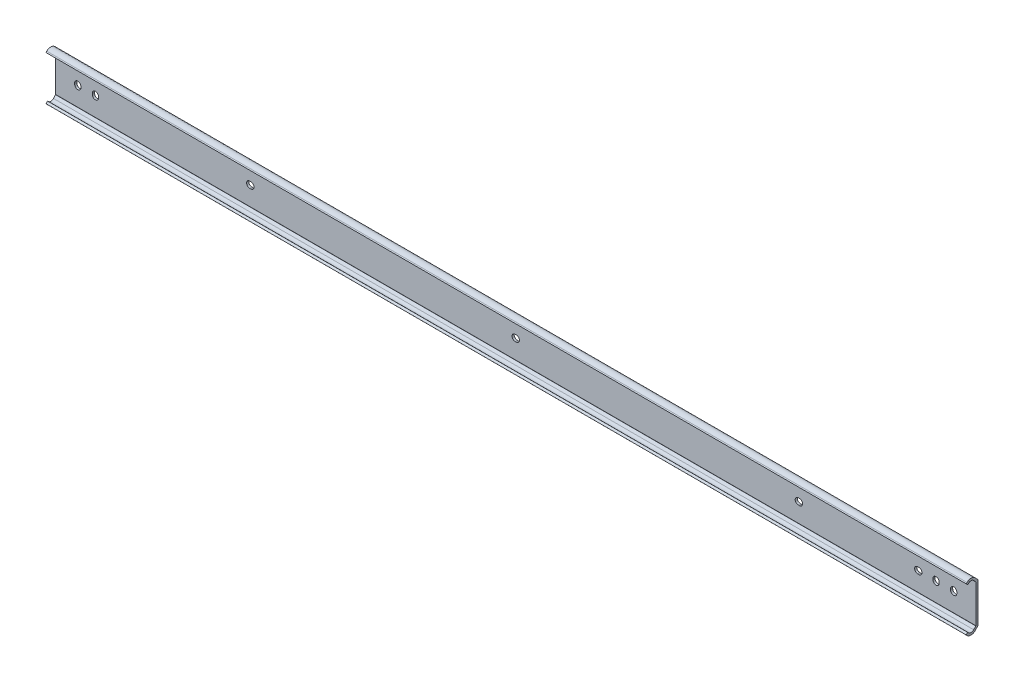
ISO-10303-21;
HEADER;
FILE_DESCRIPTION(('STEP AP214'),'2;1');
FILE_NAME('part.step','',(''),(''),'','','');
FILE_SCHEMA(('AUTOMOTIVE_DESIGN { 1 0 10303 214 1 1 1 1 }'));
ENDSEC;
DATA;
#1=APPLICATION_CONTEXT('core data for automotive mechanical design processes');
#2=APPLICATION_PROTOCOL_DEFINITION('international standard','automotive_design',2000,#1);
#3=PRODUCT_CONTEXT('',#1,'mechanical');
#4=PRODUCT('Part','Part','',(#3));
#5=PRODUCT_RELATED_PRODUCT_CATEGORY('part','',(#4));
#6=PRODUCT_DEFINITION_FORMATION('','',#4);
#7=PRODUCT_DEFINITION_CONTEXT('part definition',#1,'design');
#8=PRODUCT_DEFINITION('design','',#6,#7);
#9=PRODUCT_DEFINITION_SHAPE('','',#8);
#10=(LENGTH_UNIT() NAMED_UNIT(*) SI_UNIT(.MILLI.,.METRE.));
#11=(NAMED_UNIT(*) PLANE_ANGLE_UNIT() SI_UNIT($,.RADIAN.));
#12=(NAMED_UNIT(*) SI_UNIT($,.STERADIAN.) SOLID_ANGLE_UNIT());
#13=UNCERTAINTY_MEASURE_WITH_UNIT(LENGTH_MEASURE(1.E-05),#10,'distance_accuracy_value','');
#14=(GEOMETRIC_REPRESENTATION_CONTEXT(3) GLOBAL_UNCERTAINTY_ASSIGNED_CONTEXT((#13)) GLOBAL_UNIT_ASSIGNED_CONTEXT((#10,
#11,#12)) REPRESENTATION_CONTEXT('',''));
#15=CARTESIAN_POINT('',(0.,0.,0.));
#16=DIRECTION('',(0.,0.,1.));
#17=DIRECTION('',(1.,0.,0.));
#18=AXIS2_PLACEMENT_3D('',#15,#16,#17);
#19=CARTESIAN_POINT('',(-15.9,13.5610179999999,1.54999923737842));
#20=DIRECTION('',(0.,0.,-1.));
#21=DIRECTION('',(1.,0.,0.));
#22=AXIS2_PLACEMENT_3D('',#19,#20,#21);
#23=PLANE('',#22);
#24=DIRECTION('',(0.,1.,0.));
#25=VECTOR('',#24,1.);
#26=CARTESIAN_POINT('',(644.5,13.5610179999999,1.54999923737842));
#27=LINE('',#26,#25);
#28=CARTESIAN_POINT('',(644.5,-13.5610179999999,1.54999923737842));
#29=VERTEX_POINT('',#28);
#30=CARTESIAN_POINT('',(644.5,13.5610179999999,1.54999923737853));
#31=VERTEX_POINT('',#30);
#32=EDGE_CURVE('E614',#29,#31,#27,.T.);
#33=ORIENTED_EDGE('',*,*,#32,.T.);
#34=DIRECTION('',(1.,0.,0.));
#35=VECTOR('',#34,1.);
#36=CARTESIAN_POINT('',(-15.9,13.5610179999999,1.54999923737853));
#37=LINE('',#36,#35);
#38=CARTESIAN_POINT('',(-15.9,13.5610179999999,1.54999923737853));
#39=VERTEX_POINT('',#38);
#40=EDGE_CURVE('E707',#39,#31,#37,.T.);
#41=ORIENTED_EDGE('',*,*,#40,.F.);
#42=DIRECTION('',(0.,1.,0.));
#43=VECTOR('',#42,1.);
#44=CARTESIAN_POINT('',(-15.9,13.5610179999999,1.54999923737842));
#45=LINE('',#44,#43);
#46=CARTESIAN_POINT('',(-15.9,-13.5610179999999,1.54999923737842));
#47=VERTEX_POINT('',#46);
#48=EDGE_CURVE('E655',#47,#39,#45,.T.);
#49=ORIENTED_EDGE('',*,*,#48,.F.);
#50=DIRECTION('',(1.,0.,0.));
#51=VECTOR('',#50,1.);
#52=CARTESIAN_POINT('',(-15.9,-13.5610179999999,1.54999923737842));
#53=LINE('',#52,#51);
#54=EDGE_CURVE('E710',#47,#29,#53,.T.);
#55=ORIENTED_EDGE('',*,*,#54,.T.);
#56=EDGE_LOOP('',(#33,#41,#49,#55));
#57=FACE_BOUND('',#56,.T.);
#58=DIRECTION('',(0.,1.,0.));
#59=VECTOR('',#58,1.);
#60=CARTESIAN_POINT('',(630.85,-0.4,1.54999923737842));
#61=LINE('',#60,#59);
#62=CARTESIAN_POINT('',(630.85,-0.4,1.54999923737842));
#63=VERTEX_POINT('',#62);
#64=CARTESIAN_POINT('',(630.85,0.4,1.54999923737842));
#65=VERTEX_POINT('',#64);
#66=EDGE_CURVE('E362',#63,#65,#61,.T.);
#67=ORIENTED_EDGE('',*,*,#66,.F.);
#68=CARTESIAN_POINT('',(628.6,-0.4,1.54999923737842));
#69=DIRECTION('',(0.,0.,-1.));
#70=DIRECTION('',(1.,0.,0.));
#71=AXIS2_PLACEMENT_3D('',#68,#69,#70);
#72=CIRCLE('',#71,2.24999999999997);
#73=CARTESIAN_POINT('',(626.35,-0.4,1.54999923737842));
#74=VERTEX_POINT('',#73);
#75=EDGE_CURVE('E345',#74,#63,#72,.F.);
#76=ORIENTED_EDGE('',*,*,#75,.F.);
#77=DIRECTION('',(0.,-1.,0.));
#78=VECTOR('',#77,1.);
#79=CARTESIAN_POINT('',(626.35,0.4,1.54999923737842));
#80=LINE('',#79,#78);
#81=CARTESIAN_POINT('',(626.35,0.4,1.54999923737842));
#82=VERTEX_POINT('',#81);
#83=EDGE_CURVE('E354',#82,#74,#80,.T.);
#84=ORIENTED_EDGE('',*,*,#83,.F.);
#85=CARTESIAN_POINT('',(628.6,0.4,1.54999923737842));
#86=DIRECTION('',(0.,0.,-1.));
#87=DIRECTION('',(1.,0.,0.));
#88=AXIS2_PLACEMENT_3D('',#85,#86,#87);
#89=CIRCLE('',#88,2.24999999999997);
#90=EDGE_CURVE('E29',#65,#82,#89,.F.);
#91=ORIENTED_EDGE('',*,*,#90,.F.);
#92=EDGE_LOOP('',(#67,#76,#84,#91));
#93=FACE_BOUND('',#92,.T.);
#94=DIRECTION('',(0.,1.,0.));
#95=VECTOR('',#94,1.);
#96=CARTESIAN_POINT('',(618.15,-0.4,1.54999923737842));
#97=LINE('',#96,#95);
#98=CARTESIAN_POINT('',(618.15,-0.4,1.54999923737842));
#99=VERTEX_POINT('',#98);
#100=CARTESIAN_POINT('',(618.15,0.4,1.54999923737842));
#101=VERTEX_POINT('',#100);
#102=EDGE_CURVE('E380',#99,#101,#97,.T.);
#103=ORIENTED_EDGE('',*,*,#102,.F.);
#104=CARTESIAN_POINT('',(615.9,-0.4,1.54999923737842));
#105=DIRECTION('',(0.,0.,-1.));
#106=DIRECTION('',(1.,0.,0.));
#107=AXIS2_PLACEMENT_3D('',#104,#105,#106);
#108=CIRCLE('',#107,2.24999999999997);
#109=CARTESIAN_POINT('',(613.65,-0.4,1.54999923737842));
#110=VERTEX_POINT('',#109);
#111=EDGE_CURVE('E383',#110,#99,#108,.F.);
#112=ORIENTED_EDGE('',*,*,#111,.F.);
#113=DIRECTION('',(0.,-1.,0.));
#114=VECTOR('',#113,1.);
#115=CARTESIAN_POINT('',(613.65,0.4,1.54999923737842));
#116=LINE('',#115,#114);
#117=CARTESIAN_POINT('',(613.65,0.4,1.54999923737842));
#118=VERTEX_POINT('',#117);
#119=EDGE_CURVE('E400',#118,#110,#116,.T.);
#120=ORIENTED_EDGE('',*,*,#119,.F.);
#121=CARTESIAN_POINT('',(615.9,0.4,1.54999923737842));
#122=DIRECTION('',(0.,0.,-1.));
#123=DIRECTION('',(1.,0.,0.));
#124=AXIS2_PLACEMENT_3D('',#121,#122,#123);
#125=CIRCLE('',#124,2.24999999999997);
#126=EDGE_CURVE('E357',#101,#118,#125,.F.);
#127=ORIENTED_EDGE('',*,*,#126,.F.);
#128=EDGE_LOOP('',(#103,#112,#120,#127));
#129=FACE_BOUND('',#128,.T.);
#130=DIRECTION('',(1.,0.,0.));
#131=VECTOR('',#130,1.);
#132=CARTESIAN_POINT('',(602.8,-2.25000000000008,1.54999923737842));
#133=LINE('',#132,#131);
#134=CARTESIAN_POINT('',(602.8,-2.25000000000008,1.54999923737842));
#135=VERTEX_POINT('',#134);
#136=CARTESIAN_POINT('',(603.6,-2.25,1.54999923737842));
#137=VERTEX_POINT('',#136);
#138=EDGE_CURVE('E411',#135,#137,#133,.T.);
#139=ORIENTED_EDGE('',*,*,#138,.F.);
#140=CARTESIAN_POINT('',(602.8,0.,1.54999923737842));
#141=DIRECTION('',(0.,0.,-1.));
#142=DIRECTION('',(1.,0.,0.));
#143=AXIS2_PLACEMENT_3D('',#140,#141,#142);
#144=CIRCLE('',#143,2.25000000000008);
#145=CARTESIAN_POINT('',(602.8,2.25000000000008,1.54999923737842));
#146=VERTEX_POINT('',#145);
#147=EDGE_CURVE('E414',#146,#135,#144,.F.);
#148=ORIENTED_EDGE('',*,*,#147,.F.);
#149=DIRECTION('',(-1.,0.,0.));
#150=VECTOR('',#149,1.);
#151=CARTESIAN_POINT('',(603.6,2.25,1.54999923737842));
#152=LINE('',#151,#150);
#153=CARTESIAN_POINT('',(603.6,2.25,1.54999923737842));
#154=VERTEX_POINT('',#153);
#155=EDGE_CURVE('E431',#154,#146,#152,.T.);
#156=ORIENTED_EDGE('',*,*,#155,.F.);
#157=CARTESIAN_POINT('',(603.6,0.,1.54999923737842));
#158=DIRECTION('',(0.,0.,-1.));
#159=DIRECTION('',(1.,0.,0.));
#160=AXIS2_PLACEMENT_3D('',#157,#158,#159);
#161=CIRCLE('',#160,2.25);
#162=EDGE_CURVE('E409',#137,#154,#161,.F.);
#163=ORIENTED_EDGE('',*,*,#162,.F.);
#164=EDGE_LOOP('',(#139,#148,#156,#163));
#165=FACE_BOUND('',#164,.T.);
#166=DIRECTION('',(1.,0.,0.));
#167=VECTOR('',#166,1.);
#168=CARTESIAN_POINT('',(517.1,-2.25000000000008,1.54999923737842));
#169=LINE('',#168,#167);
#170=CARTESIAN_POINT('',(517.1,-2.25000000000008,1.54999923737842));
#171=VERTEX_POINT('',#170);
#172=CARTESIAN_POINT('',(517.9,-2.25,1.54999923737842));
#173=VERTEX_POINT('',#172);
#174=EDGE_CURVE('E442',#171,#173,#169,.T.);
#175=ORIENTED_EDGE('',*,*,#174,.F.);
#176=CARTESIAN_POINT('',(517.1,0.,1.54999923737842));
#177=DIRECTION('',(0.,0.,-1.));
#178=DIRECTION('',(1.,0.,0.));
#179=AXIS2_PLACEMENT_3D('',#176,#177,#178);
#180=CIRCLE('',#179,2.25000000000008);
#181=CARTESIAN_POINT('',(517.1,2.25000000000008,1.54999923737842));
#182=VERTEX_POINT('',#181);
#183=EDGE_CURVE('E445',#182,#171,#180,.F.);
#184=ORIENTED_EDGE('',*,*,#183,.F.);
#185=DIRECTION('',(-1.,0.,0.));
#186=VECTOR('',#185,1.);
#187=CARTESIAN_POINT('',(517.9,2.25,1.54999923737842));
#188=LINE('',#187,#186);
#189=CARTESIAN_POINT('',(517.9,2.25,1.54999923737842));
#190=VERTEX_POINT('',#189);
#191=EDGE_CURVE('E462',#190,#182,#188,.T.);
#192=ORIENTED_EDGE('',*,*,#191,.F.);
#193=CARTESIAN_POINT('',(517.9,0.,1.54999923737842));
#194=DIRECTION('',(0.,0.,-1.));
#195=DIRECTION('',(1.,0.,0.));
#196=AXIS2_PLACEMENT_3D('',#193,#194,#195);
#197=CIRCLE('',#196,2.25);
#198=EDGE_CURVE('E440',#173,#190,#197,.F.);
#199=ORIENTED_EDGE('',*,*,#198,.F.);
#200=EDGE_LOOP('',(#175,#184,#192,#199));
#201=FACE_BOUND('',#200,.T.);
#202=DIRECTION('',(1.,0.,0.));
#203=VECTOR('',#202,1.);
#204=CARTESIAN_POINT('',(313.9,-2.25000000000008,1.54999923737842));
#205=LINE('',#204,#203);
#206=CARTESIAN_POINT('',(313.9,-2.25000000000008,1.54999923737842));
#207=VERTEX_POINT('',#206);
#208=CARTESIAN_POINT('',(314.7,-2.25,1.54999923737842));
#209=VERTEX_POINT('',#208);
#210=EDGE_CURVE('E473',#207,#209,#205,.T.);
#211=ORIENTED_EDGE('',*,*,#210,.F.);
#212=CARTESIAN_POINT('',(313.9,0.,1.54999923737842));
#213=DIRECTION('',(0.,0.,-1.));
#214=DIRECTION('',(1.,0.,0.));
#215=AXIS2_PLACEMENT_3D('',#212,#213,#214);
#216=CIRCLE('',#215,2.25000000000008);
#217=CARTESIAN_POINT('',(313.9,2.25000000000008,1.54999923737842));
#218=VERTEX_POINT('',#217);
#219=EDGE_CURVE('E476',#218,#207,#216,.F.);
#220=ORIENTED_EDGE('',*,*,#219,.F.);
#221=DIRECTION('',(-1.,0.,0.));
#222=VECTOR('',#221,1.);
#223=CARTESIAN_POINT('',(314.7,2.25,1.54999923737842));
#224=LINE('',#223,#222);
#225=CARTESIAN_POINT('',(314.7,2.25,1.54999923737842));
#226=VERTEX_POINT('',#225);
#227=EDGE_CURVE('E493',#226,#218,#224,.T.);
#228=ORIENTED_EDGE('',*,*,#227,.F.);
#229=CARTESIAN_POINT('',(314.7,0.,1.54999923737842));
#230=DIRECTION('',(0.,0.,-1.));
#231=DIRECTION('',(1.,0.,0.));
#232=AXIS2_PLACEMENT_3D('',#229,#230,#231);
#233=CIRCLE('',#232,2.25);
#234=EDGE_CURVE('E471',#209,#226,#233,.F.);
#235=ORIENTED_EDGE('',*,*,#234,.F.);
#236=EDGE_LOOP('',(#211,#220,#228,#235));
#237=FACE_BOUND('',#236,.T.);
#238=DIRECTION('',(1.,0.,0.));
#239=VECTOR('',#238,1.);
#240=CARTESIAN_POINT('',(123.4,-2.25000000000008,1.54999923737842));
#241=LINE('',#240,#239);
#242=CARTESIAN_POINT('',(123.4,-2.25000000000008,1.54999923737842));
#243=VERTEX_POINT('',#242);
#244=CARTESIAN_POINT('',(124.2,-2.25,1.54999923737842));
#245=VERTEX_POINT('',#244);
#246=EDGE_CURVE('E504',#243,#245,#241,.T.);
#247=ORIENTED_EDGE('',*,*,#246,.F.);
#248=CARTESIAN_POINT('',(123.4,0.,1.54999923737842));
#249=DIRECTION('',(0.,0.,-1.));
#250=DIRECTION('',(1.,0.,0.));
#251=AXIS2_PLACEMENT_3D('',#248,#249,#250);
#252=CIRCLE('',#251,2.25000000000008);
#253=CARTESIAN_POINT('',(123.4,2.25000000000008,1.54999923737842));
#254=VERTEX_POINT('',#253);
#255=EDGE_CURVE('E507',#254,#243,#252,.F.);
#256=ORIENTED_EDGE('',*,*,#255,.F.);
#257=DIRECTION('',(-1.,0.,0.));
#258=VECTOR('',#257,1.);
#259=CARTESIAN_POINT('',(124.2,2.25,1.54999923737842));
#260=LINE('',#259,#258);
#261=CARTESIAN_POINT('',(124.2,2.25,1.54999923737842));
#262=VERTEX_POINT('',#261);
#263=EDGE_CURVE('E524',#262,#254,#260,.T.);
#264=ORIENTED_EDGE('',*,*,#263,.F.);
#265=CARTESIAN_POINT('',(124.2,0.,1.54999923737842));
#266=DIRECTION('',(0.,0.,-1.));
#267=DIRECTION('',(1.,0.,0.));
#268=AXIS2_PLACEMENT_3D('',#265,#266,#267);
#269=CIRCLE('',#268,2.25);
#270=EDGE_CURVE('E502',#245,#262,#269,.F.);
#271=ORIENTED_EDGE('',*,*,#270,.F.);
#272=EDGE_LOOP('',(#247,#256,#264,#271));
#273=FACE_BOUND('',#272,.T.);
#274=DIRECTION('',(0.,1.,0.));
#275=VECTOR('',#274,1.);
#276=CARTESIAN_POINT('',(14.95,-0.4,1.54999923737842));
#277=LINE('',#276,#275);
#278=CARTESIAN_POINT('',(14.95,-0.4,1.54999923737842));
#279=VERTEX_POINT('',#278);
#280=CARTESIAN_POINT('',(14.95,0.4,1.54999923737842));
#281=VERTEX_POINT('',#280);
#282=EDGE_CURVE('E535',#279,#281,#277,.T.);
#283=ORIENTED_EDGE('',*,*,#282,.F.);
#284=CARTESIAN_POINT('',(12.7,-0.4,1.54999923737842));
#285=DIRECTION('',(0.,0.,-1.));
#286=DIRECTION('',(1.,0.,0.));
#287=AXIS2_PLACEMENT_3D('',#284,#285,#286);
#288=CIRCLE('',#287,2.24999999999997);
#289=CARTESIAN_POINT('',(10.45,-0.4,1.54999923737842));
#290=VERTEX_POINT('',#289);
#291=EDGE_CURVE('E538',#290,#279,#288,.F.);
#292=ORIENTED_EDGE('',*,*,#291,.F.);
#293=DIRECTION('',(0.,-1.,0.));
#294=VECTOR('',#293,1.);
#295=CARTESIAN_POINT('',(10.45,0.4,1.54999923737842));
#296=LINE('',#295,#294);
#297=CARTESIAN_POINT('',(10.45,0.4,1.54999923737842));
#298=VERTEX_POINT('',#297);
#299=EDGE_CURVE('E555',#298,#290,#296,.T.);
#300=ORIENTED_EDGE('',*,*,#299,.F.);
#301=CARTESIAN_POINT('',(12.7,0.4,1.54999923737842));
#302=DIRECTION('',(0.,0.,-1.));
#303=DIRECTION('',(1.,0.,0.));
#304=AXIS2_PLACEMENT_3D('',#301,#302,#303);
#305=CIRCLE('',#304,2.24999999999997);
#306=EDGE_CURVE('E533',#281,#298,#305,.F.);
#307=ORIENTED_EDGE('',*,*,#306,.F.);
#308=EDGE_LOOP('',(#283,#292,#300,#307));
#309=FACE_BOUND('',#308,.T.);
#310=DIRECTION('',(0.,1.,0.));
#311=VECTOR('',#310,1.);
#312=CARTESIAN_POINT('',(2.24999999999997,-0.4,1.54999923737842));
#313=LINE('',#312,#311);
#314=CARTESIAN_POINT('',(2.24999999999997,-0.4,1.54999923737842));
#315=VERTEX_POINT('',#314);
#316=CARTESIAN_POINT('',(2.24999999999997,0.4,1.54999923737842));
#317=VERTEX_POINT('',#316);
#318=EDGE_CURVE('E566',#315,#317,#313,.T.);
#319=ORIENTED_EDGE('',*,*,#318,.F.);
#320=CARTESIAN_POINT('',(0.,-0.4,1.54999923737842));
#321=DIRECTION('',(0.,0.,-1.));
#322=DIRECTION('',(1.,0.,0.));
#323=AXIS2_PLACEMENT_3D('',#320,#321,#322);
#324=CIRCLE('',#323,2.24999999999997);
#325=CARTESIAN_POINT('',(-2.25000000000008,-0.4,1.54999923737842));
#326=VERTEX_POINT('',#325);
#327=EDGE_CURVE('E569',#326,#315,#324,.F.);
#328=ORIENTED_EDGE('',*,*,#327,.F.);
#329=DIRECTION('',(0.,-1.,0.));
#330=VECTOR('',#329,1.);
#331=CARTESIAN_POINT('',(-2.25000000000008,0.4,1.54999923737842));
#332=LINE('',#331,#330);
#333=CARTESIAN_POINT('',(-2.25000000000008,0.4,1.54999923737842));
#334=VERTEX_POINT('',#333);
#335=EDGE_CURVE('E586',#334,#326,#332,.T.);
#336=ORIENTED_EDGE('',*,*,#335,.F.);
#337=CARTESIAN_POINT('',(0.,0.4,1.54999923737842));
#338=DIRECTION('',(0.,0.,-1.));
#339=DIRECTION('',(1.,0.,0.));
#340=AXIS2_PLACEMENT_3D('',#337,#338,#339);
#341=CIRCLE('',#340,2.24999999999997);
#342=EDGE_CURVE('E564',#317,#334,#341,.F.);
#343=ORIENTED_EDGE('',*,*,#342,.F.);
#344=EDGE_LOOP('',(#319,#328,#336,#343));
#345=FACE_BOUND('',#344,.T.);
#346=ADVANCED_FACE('F14',(#57,#93,#129,#165,#201,#237,#273,#309,#345),#23,.F.);
#347=CARTESIAN_POINT('',(-15.9,13.5610176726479,0.));
#348=DIRECTION('',(0.,0.,1.));
#349=DIRECTION('',(-1.,0.,0.));
#350=AXIS2_PLACEMENT_3D('',#347,#348,#349);
#351=PLANE('',#350);
#352=DIRECTION('',(0.,1.,0.));
#353=VECTOR('',#352,1.);
#354=CARTESIAN_POINT('',(626.35,0.4,0.));
#355=LINE('',#354,#353);
#356=CARTESIAN_POINT('',(626.35,-0.4,0.));
#357=VERTEX_POINT('',#356);
#358=CARTESIAN_POINT('',(626.35,0.4,0.));
#359=VERTEX_POINT('',#358);
#360=EDGE_CURVE('E364',#357,#359,#355,.T.);
#361=ORIENTED_EDGE('',*,*,#360,.F.);
#362=CARTESIAN_POINT('',(628.6,-0.4,0.));
#363=DIRECTION('',(0.,0.,-1.));
#364=DIRECTION('',(1.,0.,0.));
#365=AXIS2_PLACEMENT_3D('',#362,#363,#364);
#366=CIRCLE('',#365,2.24999999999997);
#367=CARTESIAN_POINT('',(630.85,-0.4,0.));
#368=VERTEX_POINT('',#367);
#369=EDGE_CURVE('E37',#368,#357,#366,.T.);
#370=ORIENTED_EDGE('',*,*,#369,.F.);
#371=DIRECTION('',(0.,-1.,0.));
#372=VECTOR('',#371,1.);
#373=CARTESIAN_POINT('',(630.85,-0.4,0.));
#374=LINE('',#373,#372);
#375=CARTESIAN_POINT('',(630.85,0.4,0.));
#376=VERTEX_POINT('',#375);
#377=EDGE_CURVE('E351',#376,#368,#374,.T.);
#378=ORIENTED_EDGE('',*,*,#377,.F.);
#379=CARTESIAN_POINT('',(628.6,0.4,0.));
#380=DIRECTION('',(0.,0.,-1.));
#381=DIRECTION('',(1.,0.,0.));
#382=AXIS2_PLACEMENT_3D('',#379,#380,#381);
#383=CIRCLE('',#382,2.24999999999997);
#384=EDGE_CURVE('E370',#359,#376,#383,.T.);
#385=ORIENTED_EDGE('',*,*,#384,.F.);
#386=EDGE_LOOP('',(#361,#370,#378,#385));
#387=FACE_BOUND('',#386,.T.);
#388=DIRECTION('',(0.,1.,0.));
#389=VECTOR('',#388,1.);
#390=CARTESIAN_POINT('',(613.65,0.4,0.));
#391=LINE('',#390,#389);
#392=CARTESIAN_POINT('',(613.65,-0.4,0.));
#393=VERTEX_POINT('',#392);
#394=CARTESIAN_POINT('',(613.65,0.4,0.));
#395=VERTEX_POINT('',#394);
#396=EDGE_CURVE('E388',#393,#395,#391,.T.);
#397=ORIENTED_EDGE('',*,*,#396,.F.);
#398=CARTESIAN_POINT('',(615.9,-0.4,0.));
#399=DIRECTION('',(0.,0.,-1.));
#400=DIRECTION('',(1.,0.,0.));
#401=AXIS2_PLACEMENT_3D('',#398,#399,#400);
#402=CIRCLE('',#401,2.24999999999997);
#403=CARTESIAN_POINT('',(618.15,-0.4,0.));
#404=VERTEX_POINT('',#403);
#405=EDGE_CURVE('E386',#404,#393,#402,.T.);
#406=ORIENTED_EDGE('',*,*,#405,.F.);
#407=DIRECTION('',(0.,-1.,0.));
#408=VECTOR('',#407,1.);
#409=CARTESIAN_POINT('',(618.15,-0.4,0.));
#410=LINE('',#409,#408);
#411=CARTESIAN_POINT('',(618.15,0.4,0.));
#412=VERTEX_POINT('',#411);
#413=EDGE_CURVE('E394',#412,#404,#410,.T.);
#414=ORIENTED_EDGE('',*,*,#413,.F.);
#415=CARTESIAN_POINT('',(615.9,0.4,0.));
#416=DIRECTION('',(0.,0.,-1.));
#417=DIRECTION('',(1.,0.,0.));
#418=AXIS2_PLACEMENT_3D('',#415,#416,#417);
#419=CIRCLE('',#418,2.24999999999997);
#420=EDGE_CURVE('E391',#395,#412,#419,.T.);
#421=ORIENTED_EDGE('',*,*,#420,.F.);
#422=EDGE_LOOP('',(#397,#406,#414,#421));
#423=FACE_BOUND('',#422,.T.);
#424=DIRECTION('',(1.,0.,0.));
#425=VECTOR('',#424,1.);
#426=CARTESIAN_POINT('',(603.6,2.25,0.));
#427=LINE('',#426,#425);
#428=CARTESIAN_POINT('',(602.8,2.25000000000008,0.));
#429=VERTEX_POINT('',#428);
#430=CARTESIAN_POINT('',(603.6,2.25,0.));
#431=VERTEX_POINT('',#430);
#432=EDGE_CURVE('E419',#429,#431,#427,.T.);
#433=ORIENTED_EDGE('',*,*,#432,.F.);
#434=CARTESIAN_POINT('',(602.8,0.,0.));
#435=DIRECTION('',(0.,0.,-1.));
#436=DIRECTION('',(1.,0.,0.));
#437=AXIS2_PLACEMENT_3D('',#434,#435,#436);
#438=CIRCLE('',#437,2.25000000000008);
#439=CARTESIAN_POINT('',(602.8,-2.25000000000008,0.));
#440=VERTEX_POINT('',#439);
#441=EDGE_CURVE('E417',#440,#429,#438,.T.);
#442=ORIENTED_EDGE('',*,*,#441,.F.);
#443=DIRECTION('',(-1.,0.,0.));
#444=VECTOR('',#443,1.);
#445=CARTESIAN_POINT('',(602.8,-2.25000000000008,0.));
#446=LINE('',#445,#444);
#447=CARTESIAN_POINT('',(603.6,-2.25,0.));
#448=VERTEX_POINT('',#447);
#449=EDGE_CURVE('E425',#448,#440,#446,.T.);
#450=ORIENTED_EDGE('',*,*,#449,.F.);
#451=CARTESIAN_POINT('',(603.6,0.,0.));
#452=DIRECTION('',(0.,0.,-1.));
#453=DIRECTION('',(1.,0.,0.));
#454=AXIS2_PLACEMENT_3D('',#451,#452,#453);
#455=CIRCLE('',#454,2.25);
#456=EDGE_CURVE('E422',#431,#448,#455,.T.);
#457=ORIENTED_EDGE('',*,*,#456,.F.);
#458=EDGE_LOOP('',(#433,#442,#450,#457));
#459=FACE_BOUND('',#458,.T.);
#460=DIRECTION('',(1.,0.,0.));
#461=VECTOR('',#460,1.);
#462=CARTESIAN_POINT('',(517.9,2.25,0.));
#463=LINE('',#462,#461);
#464=CARTESIAN_POINT('',(517.1,2.25000000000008,0.));
#465=VERTEX_POINT('',#464);
#466=CARTESIAN_POINT('',(517.9,2.25,0.));
#467=VERTEX_POINT('',#466);
#468=EDGE_CURVE('E450',#465,#467,#463,.T.);
#469=ORIENTED_EDGE('',*,*,#468,.F.);
#470=CARTESIAN_POINT('',(517.1,0.,0.));
#471=DIRECTION('',(0.,0.,-1.));
#472=DIRECTION('',(1.,0.,0.));
#473=AXIS2_PLACEMENT_3D('',#470,#471,#472);
#474=CIRCLE('',#473,2.25000000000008);
#475=CARTESIAN_POINT('',(517.1,-2.25000000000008,0.));
#476=VERTEX_POINT('',#475);
#477=EDGE_CURVE('E448',#476,#465,#474,.T.);
#478=ORIENTED_EDGE('',*,*,#477,.F.);
#479=DIRECTION('',(-1.,0.,0.));
#480=VECTOR('',#479,1.);
#481=CARTESIAN_POINT('',(517.1,-2.25000000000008,0.));
#482=LINE('',#481,#480);
#483=CARTESIAN_POINT('',(517.9,-2.25,0.));
#484=VERTEX_POINT('',#483);
#485=EDGE_CURVE('E456',#484,#476,#482,.T.);
#486=ORIENTED_EDGE('',*,*,#485,.F.);
#487=CARTESIAN_POINT('',(517.9,0.,0.));
#488=DIRECTION('',(0.,0.,-1.));
#489=DIRECTION('',(1.,0.,0.));
#490=AXIS2_PLACEMENT_3D('',#487,#488,#489);
#491=CIRCLE('',#490,2.25);
#492=EDGE_CURVE('E453',#467,#484,#491,.T.);
#493=ORIENTED_EDGE('',*,*,#492,.F.);
#494=EDGE_LOOP('',(#469,#478,#486,#493));
#495=FACE_BOUND('',#494,.T.);
#496=DIRECTION('',(1.,0.,0.));
#497=VECTOR('',#496,1.);
#498=CARTESIAN_POINT('',(314.7,2.25,0.));
#499=LINE('',#498,#497);
#500=CARTESIAN_POINT('',(313.9,2.25000000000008,0.));
#501=VERTEX_POINT('',#500);
#502=CARTESIAN_POINT('',(314.7,2.25,0.));
#503=VERTEX_POINT('',#502);
#504=EDGE_CURVE('E481',#501,#503,#499,.T.);
#505=ORIENTED_EDGE('',*,*,#504,.F.);
#506=CARTESIAN_POINT('',(313.9,0.,0.));
#507=DIRECTION('',(0.,0.,-1.));
#508=DIRECTION('',(1.,0.,0.));
#509=AXIS2_PLACEMENT_3D('',#506,#507,#508);
#510=CIRCLE('',#509,2.25000000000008);
#511=CARTESIAN_POINT('',(313.9,-2.25000000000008,0.));
#512=VERTEX_POINT('',#511);
#513=EDGE_CURVE('E479',#512,#501,#510,.T.);
#514=ORIENTED_EDGE('',*,*,#513,.F.);
#515=DIRECTION('',(-1.,0.,0.));
#516=VECTOR('',#515,1.);
#517=CARTESIAN_POINT('',(313.9,-2.25000000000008,0.));
#518=LINE('',#517,#516);
#519=CARTESIAN_POINT('',(314.7,-2.25,0.));
#520=VERTEX_POINT('',#519);
#521=EDGE_CURVE('E487',#520,#512,#518,.T.);
#522=ORIENTED_EDGE('',*,*,#521,.F.);
#523=CARTESIAN_POINT('',(314.7,0.,0.));
#524=DIRECTION('',(0.,0.,-1.));
#525=DIRECTION('',(1.,0.,0.));
#526=AXIS2_PLACEMENT_3D('',#523,#524,#525);
#527=CIRCLE('',#526,2.25);
#528=EDGE_CURVE('E484',#503,#520,#527,.T.);
#529=ORIENTED_EDGE('',*,*,#528,.F.);
#530=EDGE_LOOP('',(#505,#514,#522,#529));
#531=FACE_BOUND('',#530,.T.);
#532=DIRECTION('',(1.,0.,0.));
#533=VECTOR('',#532,1.);
#534=CARTESIAN_POINT('',(124.2,2.25,0.));
#535=LINE('',#534,#533);
#536=CARTESIAN_POINT('',(123.4,2.25000000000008,0.));
#537=VERTEX_POINT('',#536);
#538=CARTESIAN_POINT('',(124.2,2.25,0.));
#539=VERTEX_POINT('',#538);
#540=EDGE_CURVE('E512',#537,#539,#535,.T.);
#541=ORIENTED_EDGE('',*,*,#540,.F.);
#542=CARTESIAN_POINT('',(123.4,0.,0.));
#543=DIRECTION('',(0.,0.,-1.));
#544=DIRECTION('',(1.,0.,0.));
#545=AXIS2_PLACEMENT_3D('',#542,#543,#544);
#546=CIRCLE('',#545,2.25000000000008);
#547=CARTESIAN_POINT('',(123.4,-2.25000000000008,0.));
#548=VERTEX_POINT('',#547);
#549=EDGE_CURVE('E510',#548,#537,#546,.T.);
#550=ORIENTED_EDGE('',*,*,#549,.F.);
#551=DIRECTION('',(-1.,0.,0.));
#552=VECTOR('',#551,1.);
#553=CARTESIAN_POINT('',(123.4,-2.25000000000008,0.));
#554=LINE('',#553,#552);
#555=CARTESIAN_POINT('',(124.2,-2.25,0.));
#556=VERTEX_POINT('',#555);
#557=EDGE_CURVE('E518',#556,#548,#554,.T.);
#558=ORIENTED_EDGE('',*,*,#557,.F.);
#559=CARTESIAN_POINT('',(124.2,0.,0.));
#560=DIRECTION('',(0.,0.,-1.));
#561=DIRECTION('',(1.,0.,0.));
#562=AXIS2_PLACEMENT_3D('',#559,#560,#561);
#563=CIRCLE('',#562,2.25);
#564=EDGE_CURVE('E515',#539,#556,#563,.T.);
#565=ORIENTED_EDGE('',*,*,#564,.F.);
#566=EDGE_LOOP('',(#541,#550,#558,#565));
#567=FACE_BOUND('',#566,.T.);
#568=DIRECTION('',(0.,1.,0.));
#569=VECTOR('',#568,1.);
#570=CARTESIAN_POINT('',(10.45,0.4,0.));
#571=LINE('',#570,#569);
#572=CARTESIAN_POINT('',(10.45,-0.4,0.));
#573=VERTEX_POINT('',#572);
#574=CARTESIAN_POINT('',(10.45,0.4,0.));
#575=VERTEX_POINT('',#574);
#576=EDGE_CURVE('E543',#573,#575,#571,.T.);
#577=ORIENTED_EDGE('',*,*,#576,.F.);
#578=CARTESIAN_POINT('',(12.7,-0.4,0.));
#579=DIRECTION('',(0.,0.,-1.));
#580=DIRECTION('',(1.,0.,0.));
#581=AXIS2_PLACEMENT_3D('',#578,#579,#580);
#582=CIRCLE('',#581,2.24999999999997);
#583=CARTESIAN_POINT('',(14.95,-0.4,0.));
#584=VERTEX_POINT('',#583);
#585=EDGE_CURVE('E541',#584,#573,#582,.T.);
#586=ORIENTED_EDGE('',*,*,#585,.F.);
#587=DIRECTION('',(0.,-1.,0.));
#588=VECTOR('',#587,1.);
#589=CARTESIAN_POINT('',(14.95,-0.4,0.));
#590=LINE('',#589,#588);
#591=CARTESIAN_POINT('',(14.95,0.4,0.));
#592=VERTEX_POINT('',#591);
#593=EDGE_CURVE('E549',#592,#584,#590,.T.);
#594=ORIENTED_EDGE('',*,*,#593,.F.);
#595=CARTESIAN_POINT('',(12.7,0.4,0.));
#596=DIRECTION('',(0.,0.,-1.));
#597=DIRECTION('',(1.,0.,0.));
#598=AXIS2_PLACEMENT_3D('',#595,#596,#597);
#599=CIRCLE('',#598,2.24999999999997);
#600=EDGE_CURVE('E546',#575,#592,#599,.T.);
#601=ORIENTED_EDGE('',*,*,#600,.F.);
#602=EDGE_LOOP('',(#577,#586,#594,#601));
#603=FACE_BOUND('',#602,.T.);
#604=DIRECTION('',(0.,1.,0.));
#605=VECTOR('',#604,1.);
#606=CARTESIAN_POINT('',(-2.25000000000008,0.4,0.));
#607=LINE('',#606,#605);
#608=CARTESIAN_POINT('',(-2.25000000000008,-0.4,0.));
#609=VERTEX_POINT('',#608);
#610=CARTESIAN_POINT('',(-2.25000000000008,0.4,0.));
#611=VERTEX_POINT('',#610);
#612=EDGE_CURVE('E574',#609,#611,#607,.T.);
#613=ORIENTED_EDGE('',*,*,#612,.F.);
#614=CARTESIAN_POINT('',(0.,-0.4,0.));
#615=DIRECTION('',(0.,0.,-1.));
#616=DIRECTION('',(1.,0.,0.));
#617=AXIS2_PLACEMENT_3D('',#614,#615,#616);
#618=CIRCLE('',#617,2.24999999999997);
#619=CARTESIAN_POINT('',(2.24999999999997,-0.4,0.));
#620=VERTEX_POINT('',#619);
#621=EDGE_CURVE('E572',#620,#609,#618,.T.);
#622=ORIENTED_EDGE('',*,*,#621,.F.);
#623=DIRECTION('',(0.,-1.,0.));
#624=VECTOR('',#623,1.);
#625=CARTESIAN_POINT('',(2.24999999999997,-0.4,0.));
#626=LINE('',#625,#624);
#627=CARTESIAN_POINT('',(2.24999999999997,0.4,0.));
#628=VERTEX_POINT('',#627);
#629=EDGE_CURVE('E580',#628,#620,#626,.T.);
#630=ORIENTED_EDGE('',*,*,#629,.F.);
#631=CARTESIAN_POINT('',(0.,0.4,0.));
#632=DIRECTION('',(0.,0.,-1.));
#633=DIRECTION('',(1.,0.,0.));
#634=AXIS2_PLACEMENT_3D('',#631,#632,#633);
#635=CIRCLE('',#634,2.24999999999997);
#636=EDGE_CURVE('E577',#611,#628,#635,.T.);
#637=ORIENTED_EDGE('',*,*,#636,.F.);
#638=EDGE_LOOP('',(#613,#622,#630,#637));
#639=FACE_BOUND('',#638,.T.);
#640=DIRECTION('',(0.,-1.,0.));
#641=VECTOR('',#640,1.);
#642=CARTESIAN_POINT('',(644.5,13.5610176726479,0.));
#643=LINE('',#642,#641);
#644=CARTESIAN_POINT('',(644.5,13.5610176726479,0.));
#645=VERTEX_POINT('',#644);
#646=CARTESIAN_POINT('',(644.5,-13.5610176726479,0.));
#647=VERTEX_POINT('',#646);
#648=EDGE_CURVE('E634',#645,#647,#643,.T.);
#649=ORIENTED_EDGE('',*,*,#648,.T.);
#650=DIRECTION('',(1.,0.,0.));
#651=VECTOR('',#650,1.);
#652=CARTESIAN_POINT('',(-15.9,-13.5610176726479,0.));
#653=LINE('',#652,#651);
#654=CARTESIAN_POINT('',(-15.9,-13.5610176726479,0.));
#655=VERTEX_POINT('',#654);
#656=EDGE_CURVE('E677',#655,#647,#653,.T.);
#657=ORIENTED_EDGE('',*,*,#656,.F.);
#658=DIRECTION('',(0.,-1.,0.));
#659=VECTOR('',#658,1.);
#660=CARTESIAN_POINT('',(-15.9,13.5610176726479,0.));
#661=LINE('',#660,#659);
#662=CARTESIAN_POINT('',(-15.9,13.5610176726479,0.));
#663=VERTEX_POINT('',#662);
#664=EDGE_CURVE('E675',#663,#655,#661,.T.);
#665=ORIENTED_EDGE('',*,*,#664,.F.);
#666=DIRECTION('',(1.,0.,0.));
#667=VECTOR('',#666,1.);
#668=CARTESIAN_POINT('',(-15.9,13.5610176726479,0.));
#669=LINE('',#668,#667);
#670=EDGE_CURVE('E680',#663,#645,#669,.T.);
#671=ORIENTED_EDGE('',*,*,#670,.T.);
#672=EDGE_LOOP('',(#649,#657,#665,#671));
#673=FACE_BOUND('',#672,.T.);
#674=ADVANCED_FACE('F765',(#387,#423,#459,#495,#531,#567,#603,#639,#673),#351,.F.);
#675=CARTESIAN_POINT('',(-15.9,-13.5610175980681,1.80000204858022));
#676=DIRECTION('',(1.,0.,0.));
#677=DIRECTION('',(0.,0.,1.));
#678=AXIS2_PLACEMENT_3D('',#675,#676,#677);
#679=PLANE('',#678);
#680=ORIENTED_EDGE('',*,*,#48,.T.);
#681=CARTESIAN_POINT('',(-15.9,13.5610175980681,1.80000204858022));
#682=DIRECTION('',(1.,0.,0.));
#683=DIRECTION('',(0.,0.,1.));
#684=AXIS2_PLACEMENT_3D('',#681,#682,#683);
#685=CIRCLE('',#684,0.250002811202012);
#686=CARTESIAN_POINT('',(-15.9,13.7341215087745,1.61962344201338));
#687=VERTEX_POINT('',#686);
#688=EDGE_CURVE('E657',#39,#687,#685,.T.);
#689=ORIENTED_EDGE('',*,*,#688,.T.);
#690=DIRECTION('',(0.,0.72150413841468,0.692410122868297));
#691=VECTOR('',#690,1.);
#692=CARTESIAN_POINT('',(-15.9,13.7341215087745,1.61962344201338));
#693=LINE('',#692,#691);
#694=CARTESIAN_POINT('',(-15.9,15.2920521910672,3.11473194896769));
#695=VERTEX_POINT('',#694);
#696=EDGE_CURVE('E659',#687,#695,#693,.T.);
#697=ORIENTED_EDGE('',*,*,#696,.T.);
#698=CARTESIAN_POINT('',(-15.9,13.5750002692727,4.99999970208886));
#699=DIRECTION('',(1.,0.,0.));
#700=DIRECTION('',(0.,0.,1.));
#701=AXIS2_PLACEMENT_3D('',#698,#699,#700);
#702=CIRCLE('',#701,2.55000035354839);
#703=CARTESIAN_POINT('',(-15.9,15.2920597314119,6.88526058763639));
#704=VERTEX_POINT('',#703);
#705=EDGE_CURVE('E661',#695,#704,#702,.T.);
#706=ORIENTED_EDGE('',*,*,#705,.T.);
#707=DIRECTION('',(0.,-0.721504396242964,0.692409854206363));
#708=VECTOR('',#707,1.);
#709=CARTESIAN_POINT('',(-15.9,15.2920597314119,6.88526058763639));
#710=LINE('',#709,#708);
#711=CARTESIAN_POINT('',(-15.9,14.7934625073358,7.36375196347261));
#712=VERTEX_POINT('',#711);
#713=EDGE_CURVE('E663',#704,#712,#710,.T.);
#714=ORIENTED_EDGE('',*,*,#713,.T.);
#715=DIRECTION('',(0.,0.707106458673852,0.707107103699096));
#716=VECTOR('',#715,1.);
#717=CARTESIAN_POINT('',(-15.9,14.7934625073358,7.36375196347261));
#718=LINE('',#717,#716);
#719=CARTESIAN_POINT('',(-15.9,15.8897095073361,8.45999996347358));
#720=VERTEX_POINT('',#719);
#721=EDGE_CURVE('E665',#712,#720,#718,.T.);
#722=ORIENTED_EDGE('',*,*,#721,.T.);
#723=DIRECTION('',(0.,0.721503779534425,-0.692410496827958));
#724=VECTOR('',#723,1.);
#725=CARTESIAN_POINT('',(-15.9,16.4741385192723,7.89913695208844));
#726=LINE('',#725,#724);
#727=CARTESIAN_POINT('',(-15.9,16.4741385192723,7.89913695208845));
#728=VERTEX_POINT('',#727);
#729=EDGE_CURVE('E667',#720,#728,#726,.T.);
#730=ORIENTED_EDGE('',*,*,#729,.T.);
#731=CARTESIAN_POINT('',(-15.9,13.5750002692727,4.99999970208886));
#732=DIRECTION('',(-1.,0.,0.));
#733=DIRECTION('',(0.,0.,-1.));
#734=AXIS2_PLACEMENT_3D('',#731,#732,#733);
#735=CIRCLE('',#734,4.09999992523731);
#736=CARTESIAN_POINT('',(-15.9,16.4741380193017,2.10086195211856));
#737=VERTEX_POINT('',#736);
#738=EDGE_CURVE('E669',#728,#737,#735,.T.);
#739=ORIENTED_EDGE('',*,*,#738,.T.);
#740=DIRECTION('',(0.,-0.721504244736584,-0.692410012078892));
#741=VECTOR('',#740,1.);
#742=CARTESIAN_POINT('',(-15.9,14.8073560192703,0.501291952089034));
#743=LINE('',#742,#741);
#744=CARTESIAN_POINT('',(-15.9,14.8073560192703,0.501291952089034));
#745=VERTEX_POINT('',#744);
#746=EDGE_CURVE('E671',#737,#745,#743,.T.);
#747=ORIENTED_EDGE('',*,*,#746,.T.);
#748=CARTESIAN_POINT('',(-15.9,13.5610175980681,1.80000204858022));
#749=DIRECTION('',(-1.,0.,0.));
#750=DIRECTION('',(0.,0.,-1.));
#751=AXIS2_PLACEMENT_3D('',#748,#749,#750);
#752=CIRCLE('',#751,1.80000204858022);
#753=EDGE_CURVE('E673',#745,#663,#752,.T.);
#754=ORIENTED_EDGE('',*,*,#753,.T.);
#755=ORIENTED_EDGE('',*,*,#664,.T.);
#756=CARTESIAN_POINT('',(-15.9,-13.5610175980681,1.80000204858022));
#757=DIRECTION('',(-1.,0.,0.));
#758=DIRECTION('',(0.,0.,1.));
#759=AXIS2_PLACEMENT_3D('',#756,#757,#758);
#760=CIRCLE('',#759,1.80000204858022);
#761=CARTESIAN_POINT('',(-15.9,-14.8073560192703,0.501291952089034));
#762=VERTEX_POINT('',#761);
#763=EDGE_CURVE('E636',#655,#762,#760,.T.);
#764=ORIENTED_EDGE('',*,*,#763,.T.);
#765=DIRECTION('',(0.,-0.721504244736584,0.692410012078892));
#766=VECTOR('',#765,1.);
#767=CARTESIAN_POINT('',(-15.9,-14.8073560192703,0.501291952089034));
#768=LINE('',#767,#766);
#769=CARTESIAN_POINT('',(-15.9,-16.4741380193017,2.10086195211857));
#770=VERTEX_POINT('',#769);
#771=EDGE_CURVE('E639',#762,#770,#768,.T.);
#772=ORIENTED_EDGE('',*,*,#771,.T.);
#773=CARTESIAN_POINT('',(-15.9,-13.5750002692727,4.99999970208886));
#774=DIRECTION('',(-1.,0.,0.));
#775=DIRECTION('',(0.,0.,1.));
#776=AXIS2_PLACEMENT_3D('',#773,#774,#775);
#777=CIRCLE('',#776,4.09999992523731);
#778=CARTESIAN_POINT('',(-15.9,-16.4741385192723,7.89913695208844));
#779=VERTEX_POINT('',#778);
#780=EDGE_CURVE('E641',#770,#779,#777,.T.);
#781=ORIENTED_EDGE('',*,*,#780,.T.);
#782=DIRECTION('',(0.,0.721503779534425,0.692410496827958));
#783=VECTOR('',#782,1.);
#784=CARTESIAN_POINT('',(-15.9,-16.4741385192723,7.89913695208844));
#785=LINE('',#784,#783);
#786=CARTESIAN_POINT('',(-15.9,-15.8897095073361,8.45999996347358));
#787=VERTEX_POINT('',#786);
#788=EDGE_CURVE('E643',#779,#787,#785,.T.);
#789=ORIENTED_EDGE('',*,*,#788,.T.);
#790=DIRECTION('',(0.,0.707106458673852,-0.707107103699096));
#791=VECTOR('',#790,1.);
#792=CARTESIAN_POINT('',(-15.9,-14.7934625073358,7.36375196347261));
#793=LINE('',#792,#791);
#794=CARTESIAN_POINT('',(-15.9,-14.7934625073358,7.36375196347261));
#795=VERTEX_POINT('',#794);
#796=EDGE_CURVE('E645',#787,#795,#793,.T.);
#797=ORIENTED_EDGE('',*,*,#796,.T.);
#798=DIRECTION('',(0.,-0.721504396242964,-0.692409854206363));
#799=VECTOR('',#798,1.);
#800=CARTESIAN_POINT('',(-15.9,-15.2920597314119,6.88526058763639));
#801=LINE('',#800,#799);
#802=CARTESIAN_POINT('',(-15.9,-15.2920597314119,6.88526058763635));
#803=VERTEX_POINT('',#802);
#804=EDGE_CURVE('E647',#795,#803,#801,.T.);
#805=ORIENTED_EDGE('',*,*,#804,.T.);
#806=CARTESIAN_POINT('',(-15.9,-13.5750002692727,4.99999970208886));
#807=DIRECTION('',(1.,0.,0.));
#808=DIRECTION('',(0.,0.,-1.));
#809=AXIS2_PLACEMENT_3D('',#806,#807,#808);
#810=CIRCLE('',#809,2.55000035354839);
#811=CARTESIAN_POINT('',(-15.9,-15.2920521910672,3.11473194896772));
#812=VERTEX_POINT('',#811);
#813=EDGE_CURVE('E649',#803,#812,#810,.T.);
#814=ORIENTED_EDGE('',*,*,#813,.T.);
#815=DIRECTION('',(0.,0.72150413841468,-0.692410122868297));
#816=VECTOR('',#815,1.);
#817=CARTESIAN_POINT('',(-15.9,-13.7341215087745,1.61962344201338));
#818=LINE('',#817,#816);
#819=CARTESIAN_POINT('',(-15.9,-13.7341215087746,1.6196234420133));
#820=VERTEX_POINT('',#819);
#821=EDGE_CURVE('E651',#812,#820,#818,.T.);
#822=ORIENTED_EDGE('',*,*,#821,.T.);
#823=CARTESIAN_POINT('',(-15.9,-13.5610175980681,1.80000204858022));
#824=DIRECTION('',(1.,0.,0.));
#825=DIRECTION('',(0.,0.,-1.));
#826=AXIS2_PLACEMENT_3D('',#823,#824,#825);
#827=CIRCLE('',#826,0.250002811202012);
#828=EDGE_CURVE('E653',#820,#47,#827,.T.);
#829=ORIENTED_EDGE('',*,*,#828,.T.);
#830=EDGE_LOOP('',(#680,#689,#697,#706,#714,#722,#730,#739,#747,#754,#755,#764,#772,#781,#789,
#797,#805,#814,#822,#829));
#831=FACE_BOUND('',#830,.T.);
#832=ADVANCED_FACE('F754',(#831),#679,.F.);
#833=CARTESIAN_POINT('',(644.5,-13.5610175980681,1.80000204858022));
#834=DIRECTION('',(1.,0.,0.));
#835=DIRECTION('',(0.,0.,1.));
#836=AXIS2_PLACEMENT_3D('',#833,#834,#835);
#837=PLANE('',#836);
#838=CARTESIAN_POINT('',(644.5,-13.5610175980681,1.80000204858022));
#839=DIRECTION('',(-1.,0.,0.));
#840=DIRECTION('',(0.,0.,1.));
#841=AXIS2_PLACEMENT_3D('',#838,#839,#840);
#842=CIRCLE('',#841,1.80000204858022);
#843=CARTESIAN_POINT('',(644.5,-14.8073560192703,0.501291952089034));
#844=VERTEX_POINT('',#843);
#845=EDGE_CURVE('E595',#647,#844,#842,.T.);
#846=ORIENTED_EDGE('',*,*,#845,.F.);
#847=ORIENTED_EDGE('',*,*,#648,.F.);
#848=CARTESIAN_POINT('',(644.5,13.5610175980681,1.80000204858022));
#849=DIRECTION('',(-1.,0.,0.));
#850=DIRECTION('',(0.,0.,-1.));
#851=AXIS2_PLACEMENT_3D('',#848,#849,#850);
#852=CIRCLE('',#851,1.80000204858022);
#853=CARTESIAN_POINT('',(644.5,14.8073560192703,0.501291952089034));
#854=VERTEX_POINT('',#853);
#855=EDGE_CURVE('E632',#854,#645,#852,.T.);
#856=ORIENTED_EDGE('',*,*,#855,.F.);
#857=DIRECTION('',(0.,-0.721504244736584,-0.692410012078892));
#858=VECTOR('',#857,1.);
#859=CARTESIAN_POINT('',(644.5,14.8073560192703,0.501291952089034));
#860=LINE('',#859,#858);
#861=CARTESIAN_POINT('',(644.5,16.4741380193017,2.10086195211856));
#862=VERTEX_POINT('',#861);
#863=EDGE_CURVE('E630',#862,#854,#860,.T.);
#864=ORIENTED_EDGE('',*,*,#863,.F.);
#865=CARTESIAN_POINT('',(644.5,13.5750002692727,4.99999970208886));
#866=DIRECTION('',(-1.,0.,0.));
#867=DIRECTION('',(0.,0.,-1.));
#868=AXIS2_PLACEMENT_3D('',#865,#866,#867);
#869=CIRCLE('',#868,4.09999992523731);
#870=CARTESIAN_POINT('',(644.5,16.4741385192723,7.89913695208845));
#871=VERTEX_POINT('',#870);
#872=EDGE_CURVE('E628',#871,#862,#869,.T.);
#873=ORIENTED_EDGE('',*,*,#872,.F.);
#874=DIRECTION('',(0.,0.721503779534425,-0.692410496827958));
#875=VECTOR('',#874,1.);
#876=CARTESIAN_POINT('',(644.5,16.4741385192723,7.89913695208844));
#877=LINE('',#876,#875);
#878=CARTESIAN_POINT('',(644.5,15.8897095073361,8.45999996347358));
#879=VERTEX_POINT('',#878);
#880=EDGE_CURVE('E626',#879,#871,#877,.T.);
#881=ORIENTED_EDGE('',*,*,#880,.F.);
#882=DIRECTION('',(0.,0.707106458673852,0.707107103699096));
#883=VECTOR('',#882,1.);
#884=CARTESIAN_POINT('',(644.5,14.7934625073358,7.36375196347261));
#885=LINE('',#884,#883);
#886=CARTESIAN_POINT('',(644.5,14.7934625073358,7.36375196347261));
#887=VERTEX_POINT('',#886);
#888=EDGE_CURVE('E624',#887,#879,#885,.T.);
#889=ORIENTED_EDGE('',*,*,#888,.F.);
#890=DIRECTION('',(0.,-0.721504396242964,0.692409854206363));
#891=VECTOR('',#890,1.);
#892=CARTESIAN_POINT('',(644.5,15.2920597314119,6.88526058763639));
#893=LINE('',#892,#891);
#894=CARTESIAN_POINT('',(644.5,15.2920597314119,6.88526058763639));
#895=VERTEX_POINT('',#894);
#896=EDGE_CURVE('E622',#895,#887,#893,.T.);
#897=ORIENTED_EDGE('',*,*,#896,.F.);
#898=CARTESIAN_POINT('',(644.5,13.5750002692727,4.99999970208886));
#899=DIRECTION('',(1.,0.,0.));
#900=DIRECTION('',(0.,0.,1.));
#901=AXIS2_PLACEMENT_3D('',#898,#899,#900);
#902=CIRCLE('',#901,2.55000035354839);
#903=CARTESIAN_POINT('',(644.5,15.2920521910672,3.11473194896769));
#904=VERTEX_POINT('',#903);
#905=EDGE_CURVE('E620',#904,#895,#902,.T.);
#906=ORIENTED_EDGE('',*,*,#905,.F.);
#907=DIRECTION('',(0.,0.72150413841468,0.692410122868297));
#908=VECTOR('',#907,1.);
#909=CARTESIAN_POINT('',(644.5,13.7341215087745,1.61962344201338));
#910=LINE('',#909,#908);
#911=CARTESIAN_POINT('',(644.5,13.7341215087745,1.61962344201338));
#912=VERTEX_POINT('',#911);
#913=EDGE_CURVE('E618',#912,#904,#910,.T.);
#914=ORIENTED_EDGE('',*,*,#913,.F.);
#915=CARTESIAN_POINT('',(644.5,13.5610175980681,1.80000204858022));
#916=DIRECTION('',(1.,0.,0.));
#917=DIRECTION('',(0.,0.,1.));
#918=AXIS2_PLACEMENT_3D('',#915,#916,#917);
#919=CIRCLE('',#918,0.250002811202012);
#920=EDGE_CURVE('E616',#31,#912,#919,.T.);
#921=ORIENTED_EDGE('',*,*,#920,.F.);
#922=ORIENTED_EDGE('',*,*,#32,.F.);
#923=CARTESIAN_POINT('',(644.5,-13.5610175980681,1.80000204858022));
#924=DIRECTION('',(1.,0.,0.));
#925=DIRECTION('',(0.,0.,-1.));
#926=AXIS2_PLACEMENT_3D('',#923,#924,#925);
#927=CIRCLE('',#926,0.250002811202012);
#928=CARTESIAN_POINT('',(644.5,-13.7341215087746,1.6196234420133));
#929=VERTEX_POINT('',#928);
#930=EDGE_CURVE('E612',#929,#29,#927,.T.);
#931=ORIENTED_EDGE('',*,*,#930,.F.);
#932=DIRECTION('',(0.,0.72150413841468,-0.692410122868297));
#933=VECTOR('',#932,1.);
#934=CARTESIAN_POINT('',(644.5,-13.7341215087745,1.61962344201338));
#935=LINE('',#934,#933);
#936=CARTESIAN_POINT('',(644.5,-15.2920521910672,3.11473194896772));
#937=VERTEX_POINT('',#936);
#938=EDGE_CURVE('E610',#937,#929,#935,.T.);
#939=ORIENTED_EDGE('',*,*,#938,.F.);
#940=CARTESIAN_POINT('',(644.5,-13.5750002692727,4.99999970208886));
#941=DIRECTION('',(1.,0.,0.));
#942=DIRECTION('',(0.,0.,-1.));
#943=AXIS2_PLACEMENT_3D('',#940,#941,#942);
#944=CIRCLE('',#943,2.55000035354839);
#945=CARTESIAN_POINT('',(644.5,-15.2920597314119,6.88526058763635));
#946=VERTEX_POINT('',#945);
#947=EDGE_CURVE('E608',#946,#937,#944,.T.);
#948=ORIENTED_EDGE('',*,*,#947,.F.);
#949=DIRECTION('',(0.,-0.721504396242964,-0.692409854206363));
#950=VECTOR('',#949,1.);
#951=CARTESIAN_POINT('',(644.5,-15.2920597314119,6.88526058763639));
#952=LINE('',#951,#950);
#953=CARTESIAN_POINT('',(644.5,-14.7934625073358,7.36375196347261));
#954=VERTEX_POINT('',#953);
#955=EDGE_CURVE('E606',#954,#946,#952,.T.);
#956=ORIENTED_EDGE('',*,*,#955,.F.);
#957=DIRECTION('',(0.,0.707106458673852,-0.707107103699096));
#958=VECTOR('',#957,1.);
#959=CARTESIAN_POINT('',(644.5,-14.7934625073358,7.36375196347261));
#960=LINE('',#959,#958);
#961=CARTESIAN_POINT('',(644.5,-15.8897095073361,8.45999996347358));
#962=VERTEX_POINT('',#961);
#963=EDGE_CURVE('E604',#962,#954,#960,.T.);
#964=ORIENTED_EDGE('',*,*,#963,.F.);
#965=DIRECTION('',(0.,0.721503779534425,0.692410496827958));
#966=VECTOR('',#965,1.);
#967=CARTESIAN_POINT('',(644.5,-16.4741385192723,7.89913695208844));
#968=LINE('',#967,#966);
#969=CARTESIAN_POINT('',(644.5,-16.4741385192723,7.89913695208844));
#970=VERTEX_POINT('',#969);
#971=EDGE_CURVE('E602',#970,#962,#968,.T.);
#972=ORIENTED_EDGE('',*,*,#971,.F.);
#973=CARTESIAN_POINT('',(644.5,-13.5750002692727,4.99999970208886));
#974=DIRECTION('',(-1.,0.,0.));
#975=DIRECTION('',(0.,0.,1.));
#976=AXIS2_PLACEMENT_3D('',#973,#974,#975);
#977=CIRCLE('',#976,4.09999992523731);
#978=CARTESIAN_POINT('',(644.5,-16.4741380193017,2.10086195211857));
#979=VERTEX_POINT('',#978);
#980=EDGE_CURVE('E600',#979,#970,#977,.T.);
#981=ORIENTED_EDGE('',*,*,#980,.F.);
#982=DIRECTION('',(0.,-0.721504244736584,0.692410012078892));
#983=VECTOR('',#982,1.);
#984=CARTESIAN_POINT('',(644.5,-14.8073560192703,0.501291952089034));
#985=LINE('',#984,#983);
#986=EDGE_CURVE('E598',#844,#979,#985,.T.);
#987=ORIENTED_EDGE('',*,*,#986,.F.);
#988=EDGE_LOOP('',(#846,#847,#856,#864,#873,#881,#889,#897,#906,#914,#921,#922,#931,#939,#948,
#956,#964,#972,#981,#987));
#989=FACE_BOUND('',#988,.T.);
#990=ADVANCED_FACE('F741',(#989),#837,.T.);
#991=CARTESIAN_POINT('',(-15.9,-13.5610175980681,1.80000204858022));
#992=DIRECTION('',(1.,0.,0.));
#993=DIRECTION('',(0.,0.,1.));
#994=AXIS2_PLACEMENT_3D('',#991,#992,#993);
#995=CYLINDRICAL_SURFACE('',#994,1.80000204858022);
#996=ORIENTED_EDGE('',*,*,#845,.T.);
#997=DIRECTION('',(1.,0.,0.));
#998=VECTOR('',#997,1.);
#999=CARTESIAN_POINT('',(-15.9,-14.8073560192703,0.501291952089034));
#1000=LINE('',#999,#998);
#1001=EDGE_CURVE('E9',#762,#844,#1000,.T.);
#1002=ORIENTED_EDGE('',*,*,#1001,.F.);
#1003=ORIENTED_EDGE('',*,*,#763,.F.);
#1004=ORIENTED_EDGE('',*,*,#656,.T.);
#1005=EDGE_LOOP('',(#996,#1002,#1003,#1004));
#1006=FACE_BOUND('',#1005,.T.);
#1007=ADVANCED_FACE('F16',(#1006),#995,.T.);
#1008=CARTESIAN_POINT('',(-15.9,-14.8073560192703,0.501291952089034));
#1009=DIRECTION('',(0.,0.692410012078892,0.721504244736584));
#1010=DIRECTION('',(0.,0.721504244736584,-0.692410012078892));
#1011=AXIS2_PLACEMENT_3D('',#1008,#1009,#1010);
#1012=PLANE('',#1011);
#1013=ORIENTED_EDGE('',*,*,#986,.T.);
#1014=DIRECTION('',(1.,0.,0.));
#1015=VECTOR('',#1014,1.);
#1016=CARTESIAN_POINT('',(-15.9,-16.4741380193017,2.10086195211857));
#1017=LINE('',#1016,#1015);
#1018=EDGE_CURVE('E22',#770,#979,#1017,.T.);
#1019=ORIENTED_EDGE('',*,*,#1018,.F.);
#1020=ORIENTED_EDGE('',*,*,#771,.F.);
#1021=ORIENTED_EDGE('',*,*,#1001,.T.);
#1022=EDGE_LOOP('',(#1013,#1019,#1020,#1021));
#1023=FACE_BOUND('',#1022,.T.);
#1024=ADVANCED_FACE('F758',(#1023),#1012,.F.);
#1025=CARTESIAN_POINT('',(-15.9,-13.5750002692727,4.99999970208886));
#1026=DIRECTION('',(1.,0.,0.));
#1027=DIRECTION('',(0.,0.,1.));
#1028=AXIS2_PLACEMENT_3D('',#1025,#1026,#1027);
#1029=CYLINDRICAL_SURFACE('',#1028,4.09999992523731);
#1030=DIRECTION('',(1.,0.,0.));
#1031=VECTOR('',#1030,1.);
#1032=CARTESIAN_POINT('',(-15.9,-16.4741385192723,7.89913695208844));
#1033=LINE('',#1032,#1031);
#1034=EDGE_CURVE('E728',#779,#970,#1033,.T.);
#1035=ORIENTED_EDGE('',*,*,#1034,.F.);
#1036=ORIENTED_EDGE('',*,*,#780,.F.);
#1037=ORIENTED_EDGE('',*,*,#1018,.T.);
#1038=ORIENTED_EDGE('',*,*,#980,.T.);
#1039=EDGE_LOOP('',(#1035,#1036,#1037,#1038));
#1040=FACE_BOUND('',#1039,.T.);
#1041=ADVANCED_FACE('F736',(#1040),#1029,.T.);
#1042=CARTESIAN_POINT('',(-15.9,-16.4741385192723,7.89913695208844));
#1043=DIRECTION('',(0.,0.692410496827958,-0.721503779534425));
#1044=DIRECTION('',(0.,-0.721503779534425,-0.692410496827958));
#1045=AXIS2_PLACEMENT_3D('',#1042,#1043,#1044);
#1046=PLANE('',#1045);
#1047=ORIENTED_EDGE('',*,*,#971,.T.);
#1048=DIRECTION('',(1.,0.,0.));
#1049=VECTOR('',#1048,1.);
#1050=CARTESIAN_POINT('',(-15.9,-15.8897095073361,8.45999996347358));
#1051=LINE('',#1050,#1049);
#1052=EDGE_CURVE('E725',#787,#962,#1051,.T.);
#1053=ORIENTED_EDGE('',*,*,#1052,.F.);
#1054=ORIENTED_EDGE('',*,*,#788,.F.);
#1055=ORIENTED_EDGE('',*,*,#1034,.T.);
#1056=EDGE_LOOP('',(#1047,#1053,#1054,#1055));
#1057=FACE_BOUND('',#1056,.T.);
#1058=ADVANCED_FACE('F746',(#1057),#1046,.F.);
#1059=CARTESIAN_POINT('',(-15.9,-14.7934625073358,7.36375196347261));
#1060=DIRECTION('',(0.,-0.707107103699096,-0.707106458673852));
#1061=DIRECTION('',(0.,-0.707106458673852,0.707107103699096));
#1062=AXIS2_PLACEMENT_3D('',#1059,#1060,#1061);
#1063=PLANE('',#1062);
#1064=ORIENTED_EDGE('',*,*,#963,.T.);
#1065=DIRECTION('',(1.,0.,0.));
#1066=VECTOR('',#1065,1.);
#1067=CARTESIAN_POINT('',(-15.9,-14.7934625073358,7.36375196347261));
#1068=LINE('',#1067,#1066);
#1069=EDGE_CURVE('E722',#795,#954,#1068,.T.);
#1070=ORIENTED_EDGE('',*,*,#1069,.F.);
#1071=ORIENTED_EDGE('',*,*,#796,.F.);
#1072=ORIENTED_EDGE('',*,*,#1052,.T.);
#1073=EDGE_LOOP('',(#1064,#1070,#1071,#1072));
#1074=FACE_BOUND('',#1073,.T.);
#1075=ADVANCED_FACE('F750',(#1074),#1063,.F.);
#1076=CARTESIAN_POINT('',(-15.9,-15.2920597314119,6.88526058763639));
#1077=DIRECTION('',(0.,-0.692409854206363,0.721504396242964));
#1078=DIRECTION('',(0.,0.721504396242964,0.692409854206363));
#1079=AXIS2_PLACEMENT_3D('',#1076,#1077,#1078);
#1080=PLANE('',#1079);
#1081=ORIENTED_EDGE('',*,*,#955,.T.);
#1082=DIRECTION('',(1.,0.,0.));
#1083=VECTOR('',#1082,1.);
#1084=CARTESIAN_POINT('',(-15.9,-15.2920597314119,6.88526058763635));
#1085=LINE('',#1084,#1083);
#1086=EDGE_CURVE('E719',#803,#946,#1085,.T.);
#1087=ORIENTED_EDGE('',*,*,#1086,.F.);
#1088=ORIENTED_EDGE('',*,*,#804,.F.);
#1089=ORIENTED_EDGE('',*,*,#1069,.T.);
#1090=EDGE_LOOP('',(#1081,#1087,#1088,#1089));
#1091=FACE_BOUND('',#1090,.T.);
#1092=ADVANCED_FACE('F830',(#1091),#1080,.F.);
#1093=CARTESIAN_POINT('',(-15.9,-13.5750002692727,4.99999970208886));
#1094=DIRECTION('',(1.,0.,0.));
#1095=DIRECTION('',(0.,0.,1.));
#1096=AXIS2_PLACEMENT_3D('',#1093,#1094,#1095);
#1097=CYLINDRICAL_SURFACE('',#1096,2.55000035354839);
#1098=ORIENTED_EDGE('',*,*,#947,.T.);
#1099=DIRECTION('',(1.,0.,0.));
#1100=VECTOR('',#1099,1.);
#1101=CARTESIAN_POINT('',(-15.9,-15.2920521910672,3.11473194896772));
#1102=LINE('',#1101,#1100);
#1103=EDGE_CURVE('E716',#812,#937,#1102,.T.);
#1104=ORIENTED_EDGE('',*,*,#1103,.F.);
#1105=ORIENTED_EDGE('',*,*,#813,.F.);
#1106=ORIENTED_EDGE('',*,*,#1086,.T.);
#1107=EDGE_LOOP('',(#1098,#1104,#1105,#1106));
#1108=FACE_BOUND('',#1107,.T.);
#1109=ADVANCED_FACE('F828',(#1108),#1097,.F.);
#1110=CARTESIAN_POINT('',(-15.9,-13.7341215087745,1.61962344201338));
#1111=DIRECTION('',(0.,-0.692410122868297,-0.72150413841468));
#1112=DIRECTION('',(0.,-0.72150413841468,0.692410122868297));
#1113=AXIS2_PLACEMENT_3D('',#1110,#1111,#1112);
#1114=PLANE('',#1113);
#1115=ORIENTED_EDGE('',*,*,#938,.T.);
#1116=DIRECTION('',(1.,0.,0.));
#1117=VECTOR('',#1116,1.);
#1118=CARTESIAN_POINT('',(-15.9,-13.7341215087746,1.6196234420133));
#1119=LINE('',#1118,#1117);
#1120=EDGE_CURVE('E713',#820,#929,#1119,.T.);
#1121=ORIENTED_EDGE('',*,*,#1120,.F.);
#1122=ORIENTED_EDGE('',*,*,#821,.F.);
#1123=ORIENTED_EDGE('',*,*,#1103,.T.);
#1124=EDGE_LOOP('',(#1115,#1121,#1122,#1123));
#1125=FACE_BOUND('',#1124,.T.);
#1126=ADVANCED_FACE('F823',(#1125),#1114,.F.);
#1127=CARTESIAN_POINT('',(-15.9,-13.5610175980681,1.80000204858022));
#1128=DIRECTION('',(1.,0.,0.));
#1129=DIRECTION('',(0.,0.,1.));
#1130=AXIS2_PLACEMENT_3D('',#1127,#1128,#1129);
#1131=CYLINDRICAL_SURFACE('',#1130,0.250002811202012);
#1132=ORIENTED_EDGE('',*,*,#930,.T.);
#1133=ORIENTED_EDGE('',*,*,#54,.F.);
#1134=ORIENTED_EDGE('',*,*,#828,.F.);
#1135=ORIENTED_EDGE('',*,*,#1120,.T.);
#1136=EDGE_LOOP('',(#1132,#1133,#1134,#1135));
#1137=FACE_BOUND('',#1136,.T.);
#1138=ADVANCED_FACE('F818',(#1137),#1131,.F.);
#1139=CARTESIAN_POINT('',(-15.9,13.5610175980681,1.80000204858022));
#1140=DIRECTION('',(1.,0.,0.));
#1141=DIRECTION('',(0.,0.,1.));
#1142=AXIS2_PLACEMENT_3D('',#1139,#1140,#1141);
#1143=CYLINDRICAL_SURFACE('',#1142,0.250002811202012);
#1144=ORIENTED_EDGE('',*,*,#920,.T.);
#1145=DIRECTION('',(1.,0.,0.));
#1146=VECTOR('',#1145,1.);
#1147=CARTESIAN_POINT('',(-15.9,13.7341215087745,1.61962344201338));
#1148=LINE('',#1147,#1146);
#1149=EDGE_CURVE('E704',#687,#912,#1148,.T.);
#1150=ORIENTED_EDGE('',*,*,#1149,.F.);
#1151=ORIENTED_EDGE('',*,*,#688,.F.);
#1152=ORIENTED_EDGE('',*,*,#40,.T.);
#1153=EDGE_LOOP('',(#1144,#1150,#1151,#1152));
#1154=FACE_BOUND('',#1153,.T.);
#1155=ADVANCED_FACE('F810',(#1154),#1143,.F.);
#1156=CARTESIAN_POINT('',(-15.9,13.7341215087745,1.61962344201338));
#1157=DIRECTION('',(0.,0.692410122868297,-0.72150413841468));
#1158=DIRECTION('',(0.,-0.72150413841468,-0.692410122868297));
#1159=AXIS2_PLACEMENT_3D('',#1156,#1157,#1158);
#1160=PLANE('',#1159);
#1161=ORIENTED_EDGE('',*,*,#913,.T.);
#1162=DIRECTION('',(1.,0.,0.));
#1163=VECTOR('',#1162,1.);
#1164=CARTESIAN_POINT('',(-15.9,15.2920521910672,3.11473194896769));
#1165=LINE('',#1164,#1163);
#1166=EDGE_CURVE('E701',#695,#904,#1165,.T.);
#1167=ORIENTED_EDGE('',*,*,#1166,.F.);
#1168=ORIENTED_EDGE('',*,*,#696,.F.);
#1169=ORIENTED_EDGE('',*,*,#1149,.T.);
#1170=EDGE_LOOP('',(#1161,#1167,#1168,#1169));
#1171=FACE_BOUND('',#1170,.T.);
#1172=ADVANCED_FACE('F804',(#1171),#1160,.F.);
#1173=CARTESIAN_POINT('',(-15.9,13.5750002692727,4.99999970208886));
#1174=DIRECTION('',(1.,0.,0.));
#1175=DIRECTION('',(0.,0.,1.));
#1176=AXIS2_PLACEMENT_3D('',#1173,#1174,#1175);
#1177=CYLINDRICAL_SURFACE('',#1176,2.55000035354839);
#1178=ORIENTED_EDGE('',*,*,#905,.T.);
#1179=DIRECTION('',(1.,0.,0.));
#1180=VECTOR('',#1179,1.);
#1181=CARTESIAN_POINT('',(-15.9,15.2920597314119,6.88526058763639));
#1182=LINE('',#1181,#1180);
#1183=EDGE_CURVE('E698',#704,#895,#1182,.T.);
#1184=ORIENTED_EDGE('',*,*,#1183,.F.);
#1185=ORIENTED_EDGE('',*,*,#705,.F.);
#1186=ORIENTED_EDGE('',*,*,#1166,.T.);
#1187=EDGE_LOOP('',(#1178,#1184,#1185,#1186));
#1188=FACE_BOUND('',#1187,.T.);
#1189=ADVANCED_FACE('F800',(#1188),#1177,.F.);
#1190=CARTESIAN_POINT('',(-15.9,15.2920597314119,6.88526058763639));
#1191=DIRECTION('',(0.,0.692409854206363,0.721504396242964));
#1192=DIRECTION('',(0.,0.721504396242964,-0.692409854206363));
#1193=AXIS2_PLACEMENT_3D('',#1190,#1191,#1192);
#1194=PLANE('',#1193);
#1195=ORIENTED_EDGE('',*,*,#896,.T.);
#1196=DIRECTION('',(1.,0.,0.));
#1197=VECTOR('',#1196,1.);
#1198=CARTESIAN_POINT('',(-15.9,14.7934625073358,7.36375196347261));
#1199=LINE('',#1198,#1197);
#1200=EDGE_CURVE('E695',#712,#887,#1199,.T.);
#1201=ORIENTED_EDGE('',*,*,#1200,.F.);
#1202=ORIENTED_EDGE('',*,*,#713,.F.);
#1203=ORIENTED_EDGE('',*,*,#1183,.T.);
#1204=EDGE_LOOP('',(#1195,#1201,#1202,#1203));
#1205=FACE_BOUND('',#1204,.T.);
#1206=ADVANCED_FACE('F795',(#1205),#1194,.F.);
#1207=CARTESIAN_POINT('',(-15.9,14.7934625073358,7.36375196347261));
#1208=DIRECTION('',(0.,0.707107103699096,-0.707106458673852));
#1209=DIRECTION('',(0.,-0.707106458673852,-0.707107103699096));
#1210=AXIS2_PLACEMENT_3D('',#1207,#1208,#1209);
#1211=PLANE('',#1210);
#1212=ORIENTED_EDGE('',*,*,#888,.T.);
#1213=DIRECTION('',(1.,0.,0.));
#1214=VECTOR('',#1213,1.);
#1215=CARTESIAN_POINT('',(-15.9,15.8897095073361,8.45999996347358));
#1216=LINE('',#1215,#1214);
#1217=EDGE_CURVE('E692',#720,#879,#1216,.T.);
#1218=ORIENTED_EDGE('',*,*,#1217,.F.);
#1219=ORIENTED_EDGE('',*,*,#721,.F.);
#1220=ORIENTED_EDGE('',*,*,#1200,.T.);
#1221=EDGE_LOOP('',(#1212,#1218,#1219,#1220));
#1222=FACE_BOUND('',#1221,.T.);
#1223=ADVANCED_FACE('F789',(#1222),#1211,.F.);
#1224=CARTESIAN_POINT('',(-15.9,16.4741385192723,7.89913695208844));
#1225=DIRECTION('',(0.,-0.692410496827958,-0.721503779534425));
#1226=DIRECTION('',(0.,-0.721503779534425,0.692410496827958));
#1227=AXIS2_PLACEMENT_3D('',#1224,#1225,#1226);
#1228=PLANE('',#1227);
#1229=ORIENTED_EDGE('',*,*,#880,.T.);
#1230=DIRECTION('',(1.,0.,0.));
#1231=VECTOR('',#1230,1.);
#1232=CARTESIAN_POINT('',(-15.9,16.4741385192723,7.89913695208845));
#1233=LINE('',#1232,#1231);
#1234=EDGE_CURVE('E689',#728,#871,#1233,.T.);
#1235=ORIENTED_EDGE('',*,*,#1234,.F.);
#1236=ORIENTED_EDGE('',*,*,#729,.F.);
#1237=ORIENTED_EDGE('',*,*,#1217,.T.);
#1238=EDGE_LOOP('',(#1229,#1235,#1236,#1237));
#1239=FACE_BOUND('',#1238,.T.);
#1240=ADVANCED_FACE('F785',(#1239),#1228,.F.);
#1241=CARTESIAN_POINT('',(-15.9,13.5750002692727,4.99999970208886));
#1242=DIRECTION('',(1.,0.,0.));
#1243=DIRECTION('',(0.,0.,1.));
#1244=AXIS2_PLACEMENT_3D('',#1241,#1242,#1243);
#1245=CYLINDRICAL_SURFACE('',#1244,4.09999992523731);
#1246=DIRECTION('',(1.,0.,0.));
#1247=VECTOR('',#1246,1.);
#1248=CARTESIAN_POINT('',(-15.9,16.4741380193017,2.10086195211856));
#1249=LINE('',#1248,#1247);
#1250=EDGE_CURVE('E686',#737,#862,#1249,.T.);
#1251=ORIENTED_EDGE('',*,*,#1250,.F.);
#1252=ORIENTED_EDGE('',*,*,#738,.F.);
#1253=ORIENTED_EDGE('',*,*,#1234,.T.);
#1254=ORIENTED_EDGE('',*,*,#872,.T.);
#1255=EDGE_LOOP('',(#1251,#1252,#1253,#1254));
#1256=FACE_BOUND('',#1255,.T.);
#1257=ADVANCED_FACE('F780',(#1256),#1245,.T.);
#1258=CARTESIAN_POINT('',(-15.9,14.8073560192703,0.501291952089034));
#1259=DIRECTION('',(0.,-0.692410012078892,0.721504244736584));
#1260=DIRECTION('',(0.,0.721504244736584,0.692410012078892));
#1261=AXIS2_PLACEMENT_3D('',#1258,#1259,#1260);
#1262=PLANE('',#1261);
#1263=ORIENTED_EDGE('',*,*,#863,.T.);
#1264=DIRECTION('',(1.,0.,0.));
#1265=VECTOR('',#1264,1.);
#1266=CARTESIAN_POINT('',(-15.9,14.8073560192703,0.501291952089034));
#1267=LINE('',#1266,#1265);
#1268=EDGE_CURVE('E683',#745,#854,#1267,.T.);
#1269=ORIENTED_EDGE('',*,*,#1268,.F.);
#1270=ORIENTED_EDGE('',*,*,#746,.F.);
#1271=ORIENTED_EDGE('',*,*,#1250,.T.);
#1272=EDGE_LOOP('',(#1263,#1269,#1270,#1271));
#1273=FACE_BOUND('',#1272,.T.);
#1274=ADVANCED_FACE('F774',(#1273),#1262,.F.);
#1275=CARTESIAN_POINT('',(-15.9,13.5610175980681,1.80000204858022));
#1276=DIRECTION('',(1.,0.,0.));
#1277=DIRECTION('',(0.,0.,1.));
#1278=AXIS2_PLACEMENT_3D('',#1275,#1276,#1277);
#1279=CYLINDRICAL_SURFACE('',#1278,1.80000204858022);
#1280=ORIENTED_EDGE('',*,*,#855,.T.);
#1281=ORIENTED_EDGE('',*,*,#670,.F.);
#1282=ORIENTED_EDGE('',*,*,#753,.F.);
#1283=ORIENTED_EDGE('',*,*,#1268,.T.);
#1284=EDGE_LOOP('',(#1280,#1281,#1282,#1283));
#1285=FACE_BOUND('',#1284,.T.);
#1286=ADVANCED_FACE('F770',(#1285),#1279,.T.);
#1287=CARTESIAN_POINT('',(0.,-0.4,8.46099996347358));
#1288=DIRECTION('',(0.,0.,-1.));
#1289=DIRECTION('',(1.,0.,0.));
#1290=AXIS2_PLACEMENT_3D('',#1287,#1288,#1289);
#1291=CYLINDRICAL_SURFACE('',#1290,2.24999999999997);
#1292=ORIENTED_EDGE('',*,*,#327,.T.);
#1293=DIRECTION('',(0.,0.,-1.));
#1294=VECTOR('',#1293,1.);
#1295=CARTESIAN_POINT('',(2.24999999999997,-0.4,8.46099996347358));
#1296=LINE('',#1295,#1294);
#1297=EDGE_CURVE('E584',#315,#620,#1296,.T.);
#1298=ORIENTED_EDGE('',*,*,#1297,.T.);
#1299=ORIENTED_EDGE('',*,*,#621,.T.);
#1300=DIRECTION('',(0.,0.,-1.));
#1301=VECTOR('',#1300,1.);
#1302=CARTESIAN_POINT('',(-2.25000000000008,-0.4,8.46099996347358));
#1303=LINE('',#1302,#1301);
#1304=EDGE_CURVE('E583',#326,#609,#1303,.T.);
#1305=ORIENTED_EDGE('',*,*,#1304,.F.);
#1306=EDGE_LOOP('',(#1292,#1298,#1299,#1305));
#1307=FACE_BOUND('',#1306,.T.);
#1308=ADVANCED_FACE('F931',(#1307),#1291,.F.);
#1309=CARTESIAN_POINT('',(2.24999999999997,-0.4,8.46099996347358));
#1310=DIRECTION('',(1.,0.,0.));
#1311=DIRECTION('',(0.,0.,1.));
#1312=AXIS2_PLACEMENT_3D('',#1309,#1310,#1311);
#1313=PLANE('',#1312);
#1314=ORIENTED_EDGE('',*,*,#318,.T.);
#1315=DIRECTION('',(0.,0.,-1.));
#1316=VECTOR('',#1315,1.);
#1317=CARTESIAN_POINT('',(2.24999999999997,0.4,8.46099996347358));
#1318=LINE('',#1317,#1316);
#1319=EDGE_CURVE('E587',#317,#628,#1318,.T.);
#1320=ORIENTED_EDGE('',*,*,#1319,.T.);
#1321=ORIENTED_EDGE('',*,*,#629,.T.);
#1322=ORIENTED_EDGE('',*,*,#1297,.F.);
#1323=EDGE_LOOP('',(#1314,#1320,#1321,#1322));
#1324=FACE_BOUND('',#1323,.T.);
#1325=ADVANCED_FACE('F939',(#1324),#1313,.F.);
#1326=CARTESIAN_POINT('',(0.,0.4,8.46099996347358));
#1327=DIRECTION('',(0.,0.,-1.));
#1328=DIRECTION('',(1.,0.,0.));
#1329=AXIS2_PLACEMENT_3D('',#1326,#1327,#1328);
#1330=CYLINDRICAL_SURFACE('',#1329,2.24999999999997);
#1331=ORIENTED_EDGE('',*,*,#342,.T.);
#1332=DIRECTION('',(0.,0.,-1.));
#1333=VECTOR('',#1332,1.);
#1334=CARTESIAN_POINT('',(-2.25000000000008,0.4,8.46099996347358));
#1335=LINE('',#1334,#1333);
#1336=EDGE_CURVE('E589',#334,#611,#1335,.T.);
#1337=ORIENTED_EDGE('',*,*,#1336,.T.);
#1338=ORIENTED_EDGE('',*,*,#636,.T.);
#1339=ORIENTED_EDGE('',*,*,#1319,.F.);
#1340=EDGE_LOOP('',(#1331,#1337,#1338,#1339));
#1341=FACE_BOUND('',#1340,.T.);
#1342=ADVANCED_FACE('F948',(#1341),#1330,.F.);
#1343=CARTESIAN_POINT('',(-2.25000000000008,0.4,8.46099996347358));
#1344=DIRECTION('',(-1.,0.,0.));
#1345=DIRECTION('',(0.,0.,-1.));
#1346=AXIS2_PLACEMENT_3D('',#1343,#1344,#1345);
#1347=PLANE('',#1346);
#1348=ORIENTED_EDGE('',*,*,#335,.T.);
#1349=ORIENTED_EDGE('',*,*,#1304,.T.);
#1350=ORIENTED_EDGE('',*,*,#612,.T.);
#1351=ORIENTED_EDGE('',*,*,#1336,.F.);
#1352=EDGE_LOOP('',(#1348,#1349,#1350,#1351));
#1353=FACE_BOUND('',#1352,.T.);
#1354=ADVANCED_FACE('F957',(#1353),#1347,.F.);
#1355=CARTESIAN_POINT('',(12.7,-0.4,8.46099996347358));
#1356=DIRECTION('',(0.,0.,-1.));
#1357=DIRECTION('',(1.,0.,0.));
#1358=AXIS2_PLACEMENT_3D('',#1355,#1356,#1357);
#1359=CYLINDRICAL_SURFACE('',#1358,2.24999999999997);
#1360=ORIENTED_EDGE('',*,*,#291,.T.);
#1361=DIRECTION('',(0.,0.,-1.));
#1362=VECTOR('',#1361,1.);
#1363=CARTESIAN_POINT('',(14.95,-0.4,8.46099996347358));
#1364=LINE('',#1363,#1362);
#1365=EDGE_CURVE('E553',#279,#584,#1364,.T.);
#1366=ORIENTED_EDGE('',*,*,#1365,.T.);
#1367=ORIENTED_EDGE('',*,*,#585,.T.);
#1368=DIRECTION('',(0.,0.,-1.));
#1369=VECTOR('',#1368,1.);
#1370=CARTESIAN_POINT('',(10.45,-0.4,8.46099996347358));
#1371=LINE('',#1370,#1369);
#1372=EDGE_CURVE('E552',#290,#573,#1371,.T.);
#1373=ORIENTED_EDGE('',*,*,#1372,.F.);
#1374=EDGE_LOOP('',(#1360,#1366,#1367,#1373));
#1375=FACE_BOUND('',#1374,.T.);
#1376=ADVANCED_FACE('F966',(#1375),#1359,.F.);
#1377=CARTESIAN_POINT('',(14.95,-0.4,8.46099996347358));
#1378=DIRECTION('',(1.,0.,0.));
#1379=DIRECTION('',(0.,0.,1.));
#1380=AXIS2_PLACEMENT_3D('',#1377,#1378,#1379);
#1381=PLANE('',#1380);
#1382=ORIENTED_EDGE('',*,*,#282,.T.);
#1383=DIRECTION('',(0.,0.,-1.));
#1384=VECTOR('',#1383,1.);
#1385=CARTESIAN_POINT('',(14.95,0.4,8.46099996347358));
#1386=LINE('',#1385,#1384);
#1387=EDGE_CURVE('E556',#281,#592,#1386,.T.);
#1388=ORIENTED_EDGE('',*,*,#1387,.T.);
#1389=ORIENTED_EDGE('',*,*,#593,.T.);
#1390=ORIENTED_EDGE('',*,*,#1365,.F.);
#1391=EDGE_LOOP('',(#1382,#1388,#1389,#1390));
#1392=FACE_BOUND('',#1391,.T.);
#1393=ADVANCED_FACE('F975',(#1392),#1381,.F.);
#1394=CARTESIAN_POINT('',(12.7,0.4,8.46099996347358));
#1395=DIRECTION('',(0.,0.,-1.));
#1396=DIRECTION('',(1.,0.,0.));
#1397=AXIS2_PLACEMENT_3D('',#1394,#1395,#1396);
#1398=CYLINDRICAL_SURFACE('',#1397,2.24999999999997);
#1399=ORIENTED_EDGE('',*,*,#306,.T.);
#1400=DIRECTION('',(0.,0.,-1.));
#1401=VECTOR('',#1400,1.);
#1402=CARTESIAN_POINT('',(10.45,0.4,8.46099996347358));
#1403=LINE('',#1402,#1401);
#1404=EDGE_CURVE('E558',#298,#575,#1403,.T.);
#1405=ORIENTED_EDGE('',*,*,#1404,.T.);
#1406=ORIENTED_EDGE('',*,*,#600,.T.);
#1407=ORIENTED_EDGE('',*,*,#1387,.F.);
#1408=EDGE_LOOP('',(#1399,#1405,#1406,#1407));
#1409=FACE_BOUND('',#1408,.T.);
#1410=ADVANCED_FACE('F984',(#1409),#1398,.F.);
#1411=CARTESIAN_POINT('',(10.45,0.4,8.46099996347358));
#1412=DIRECTION('',(-1.,0.,0.));
#1413=DIRECTION('',(0.,0.,-1.));
#1414=AXIS2_PLACEMENT_3D('',#1411,#1412,#1413);
#1415=PLANE('',#1414);
#1416=ORIENTED_EDGE('',*,*,#299,.T.);
#1417=ORIENTED_EDGE('',*,*,#1372,.T.);
#1418=ORIENTED_EDGE('',*,*,#576,.T.);
#1419=ORIENTED_EDGE('',*,*,#1404,.F.);
#1420=EDGE_LOOP('',(#1416,#1417,#1418,#1419));
#1421=FACE_BOUND('',#1420,.T.);
#1422=ADVANCED_FACE('F993',(#1421),#1415,.F.);
#1423=CARTESIAN_POINT('',(123.4,0.,8.46099996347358));
#1424=DIRECTION('',(0.,0.,-1.));
#1425=DIRECTION('',(1.,0.,0.));
#1426=AXIS2_PLACEMENT_3D('',#1423,#1424,#1425);
#1427=CYLINDRICAL_SURFACE('',#1426,2.25000000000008);
#1428=ORIENTED_EDGE('',*,*,#255,.T.);
#1429=DIRECTION('',(0.,0.,-1.));
#1430=VECTOR('',#1429,1.);
#1431=CARTESIAN_POINT('',(123.4,-2.25000000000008,8.46099996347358));
#1432=LINE('',#1431,#1430);
#1433=EDGE_CURVE('E522',#243,#548,#1432,.T.);
#1434=ORIENTED_EDGE('',*,*,#1433,.T.);
#1435=ORIENTED_EDGE('',*,*,#549,.T.);
#1436=DIRECTION('',(0.,0.,-1.));
#1437=VECTOR('',#1436,1.);
#1438=CARTESIAN_POINT('',(123.4,2.25000000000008,8.46099996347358));
#1439=LINE('',#1438,#1437);
#1440=EDGE_CURVE('E521',#254,#537,#1439,.T.);
#1441=ORIENTED_EDGE('',*,*,#1440,.F.);
#1442=EDGE_LOOP('',(#1428,#1434,#1435,#1441));
#1443=FACE_BOUND('',#1442,.T.);
#1444=ADVANCED_FACE('F1002',(#1443),#1427,.F.);
#1445=CARTESIAN_POINT('',(123.4,-2.25000000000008,8.46099996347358));
#1446=DIRECTION('',(0.,-1.,0.));
#1447=DIRECTION('',(-1.,0.,0.));
#1448=AXIS2_PLACEMENT_3D('',#1445,#1446,#1447);
#1449=PLANE('',#1448);
#1450=ORIENTED_EDGE('',*,*,#246,.T.);
#1451=DIRECTION('',(0.,0.,-1.));
#1452=VECTOR('',#1451,1.);
#1453=CARTESIAN_POINT('',(124.2,-2.25,8.46099996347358));
#1454=LINE('',#1453,#1452);
#1455=EDGE_CURVE('E525',#245,#556,#1454,.T.);
#1456=ORIENTED_EDGE('',*,*,#1455,.T.);
#1457=ORIENTED_EDGE('',*,*,#557,.T.);
#1458=ORIENTED_EDGE('',*,*,#1433,.F.);
#1459=EDGE_LOOP('',(#1450,#1456,#1457,#1458));
#1460=FACE_BOUND('',#1459,.T.);
#1461=ADVANCED_FACE('F1011',(#1460),#1449,.F.);
#1462=CARTESIAN_POINT('',(124.2,0.,8.46099996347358));
#1463=DIRECTION('',(0.,0.,-1.));
#1464=DIRECTION('',(1.,0.,0.));
#1465=AXIS2_PLACEMENT_3D('',#1462,#1463,#1464);
#1466=CYLINDRICAL_SURFACE('',#1465,2.25);
#1467=ORIENTED_EDGE('',*,*,#270,.T.);
#1468=DIRECTION('',(0.,0.,-1.));
#1469=VECTOR('',#1468,1.);
#1470=CARTESIAN_POINT('',(124.2,2.25,8.46099996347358));
#1471=LINE('',#1470,#1469);
#1472=EDGE_CURVE('E527',#262,#539,#1471,.T.);
#1473=ORIENTED_EDGE('',*,*,#1472,.T.);
#1474=ORIENTED_EDGE('',*,*,#564,.T.);
#1475=ORIENTED_EDGE('',*,*,#1455,.F.);
#1476=EDGE_LOOP('',(#1467,#1473,#1474,#1475));
#1477=FACE_BOUND('',#1476,.T.);
#1478=ADVANCED_FACE('F1020',(#1477),#1466,.F.);
#1479=CARTESIAN_POINT('',(124.2,2.25,8.46099996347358));
#1480=DIRECTION('',(0.,1.,0.));
#1481=DIRECTION('',(1.,0.,0.));
#1482=AXIS2_PLACEMENT_3D('',#1479,#1480,#1481);
#1483=PLANE('',#1482);
#1484=ORIENTED_EDGE('',*,*,#263,.T.);
#1485=ORIENTED_EDGE('',*,*,#1440,.T.);
#1486=ORIENTED_EDGE('',*,*,#540,.T.);
#1487=ORIENTED_EDGE('',*,*,#1472,.F.);
#1488=EDGE_LOOP('',(#1484,#1485,#1486,#1487));
#1489=FACE_BOUND('',#1488,.T.);
#1490=ADVANCED_FACE('F1029',(#1489),#1483,.F.);
#1491=CARTESIAN_POINT('',(313.9,0.,8.46099996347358));
#1492=DIRECTION('',(0.,0.,-1.));
#1493=DIRECTION('',(1.,0.,0.));
#1494=AXIS2_PLACEMENT_3D('',#1491,#1492,#1493);
#1495=CYLINDRICAL_SURFACE('',#1494,2.25000000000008);
#1496=ORIENTED_EDGE('',*,*,#219,.T.);
#1497=DIRECTION('',(0.,0.,-1.));
#1498=VECTOR('',#1497,1.);
#1499=CARTESIAN_POINT('',(313.9,-2.25000000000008,8.46099996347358));
#1500=LINE('',#1499,#1498);
#1501=EDGE_CURVE('E491',#207,#512,#1500,.T.);
#1502=ORIENTED_EDGE('',*,*,#1501,.T.);
#1503=ORIENTED_EDGE('',*,*,#513,.T.);
#1504=DIRECTION('',(0.,0.,-1.));
#1505=VECTOR('',#1504,1.);
#1506=CARTESIAN_POINT('',(313.9,2.25000000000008,8.46099996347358));
#1507=LINE('',#1506,#1505);
#1508=EDGE_CURVE('E490',#218,#501,#1507,.T.);
#1509=ORIENTED_EDGE('',*,*,#1508,.F.);
#1510=EDGE_LOOP('',(#1496,#1502,#1503,#1509));
#1511=FACE_BOUND('',#1510,.T.);
#1512=ADVANCED_FACE('F1038',(#1511),#1495,.F.);
#1513=CARTESIAN_POINT('',(313.9,-2.25000000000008,8.46099996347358));
#1514=DIRECTION('',(0.,-1.,0.));
#1515=DIRECTION('',(-1.,0.,0.));
#1516=AXIS2_PLACEMENT_3D('',#1513,#1514,#1515);
#1517=PLANE('',#1516);
#1518=ORIENTED_EDGE('',*,*,#210,.T.);
#1519=DIRECTION('',(0.,0.,-1.));
#1520=VECTOR('',#1519,1.);
#1521=CARTESIAN_POINT('',(314.7,-2.25,8.46099996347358));
#1522=LINE('',#1521,#1520);
#1523=EDGE_CURVE('E494',#209,#520,#1522,.T.);
#1524=ORIENTED_EDGE('',*,*,#1523,.T.);
#1525=ORIENTED_EDGE('',*,*,#521,.T.);
#1526=ORIENTED_EDGE('',*,*,#1501,.F.);
#1527=EDGE_LOOP('',(#1518,#1524,#1525,#1526));
#1528=FACE_BOUND('',#1527,.T.);
#1529=ADVANCED_FACE('F1047',(#1528),#1517,.F.);
#1530=CARTESIAN_POINT('',(314.7,0.,8.46099996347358));
#1531=DIRECTION('',(0.,0.,-1.));
#1532=DIRECTION('',(1.,0.,0.));
#1533=AXIS2_PLACEMENT_3D('',#1530,#1531,#1532);
#1534=CYLINDRICAL_SURFACE('',#1533,2.25);
#1535=ORIENTED_EDGE('',*,*,#234,.T.);
#1536=DIRECTION('',(0.,0.,-1.));
#1537=VECTOR('',#1536,1.);
#1538=CARTESIAN_POINT('',(314.7,2.25,8.46099996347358));
#1539=LINE('',#1538,#1537);
#1540=EDGE_CURVE('E496',#226,#503,#1539,.T.);
#1541=ORIENTED_EDGE('',*,*,#1540,.T.);
#1542=ORIENTED_EDGE('',*,*,#528,.T.);
#1543=ORIENTED_EDGE('',*,*,#1523,.F.);
#1544=EDGE_LOOP('',(#1535,#1541,#1542,#1543));
#1545=FACE_BOUND('',#1544,.T.);
#1546=ADVANCED_FACE('F1056',(#1545),#1534,.F.);
#1547=CARTESIAN_POINT('',(314.7,2.25,8.46099996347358));
#1548=DIRECTION('',(0.,1.,0.));
#1549=DIRECTION('',(1.,0.,0.));
#1550=AXIS2_PLACEMENT_3D('',#1547,#1548,#1549);
#1551=PLANE('',#1550);
#1552=ORIENTED_EDGE('',*,*,#227,.T.);
#1553=ORIENTED_EDGE('',*,*,#1508,.T.);
#1554=ORIENTED_EDGE('',*,*,#504,.T.);
#1555=ORIENTED_EDGE('',*,*,#1540,.F.);
#1556=EDGE_LOOP('',(#1552,#1553,#1554,#1555));
#1557=FACE_BOUND('',#1556,.T.);
#1558=ADVANCED_FACE('F1065',(#1557),#1551,.F.);
#1559=CARTESIAN_POINT('',(517.1,0.,8.46099996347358));
#1560=DIRECTION('',(0.,0.,-1.));
#1561=DIRECTION('',(1.,0.,0.));
#1562=AXIS2_PLACEMENT_3D('',#1559,#1560,#1561);
#1563=CYLINDRICAL_SURFACE('',#1562,2.25000000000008);
#1564=ORIENTED_EDGE('',*,*,#183,.T.);
#1565=DIRECTION('',(0.,0.,-1.));
#1566=VECTOR('',#1565,1.);
#1567=CARTESIAN_POINT('',(517.1,-2.25000000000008,8.46099996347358));
#1568=LINE('',#1567,#1566);
#1569=EDGE_CURVE('E460',#171,#476,#1568,.T.);
#1570=ORIENTED_EDGE('',*,*,#1569,.T.);
#1571=ORIENTED_EDGE('',*,*,#477,.T.);
#1572=DIRECTION('',(0.,0.,-1.));
#1573=VECTOR('',#1572,1.);
#1574=CARTESIAN_POINT('',(517.1,2.25000000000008,8.46099996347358));
#1575=LINE('',#1574,#1573);
#1576=EDGE_CURVE('E459',#182,#465,#1575,.T.);
#1577=ORIENTED_EDGE('',*,*,#1576,.F.);
#1578=EDGE_LOOP('',(#1564,#1570,#1571,#1577));
#1579=FACE_BOUND('',#1578,.T.);
#1580=ADVANCED_FACE('F1074',(#1579),#1563,.F.);
#1581=CARTESIAN_POINT('',(517.1,-2.25000000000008,8.46099996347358));
#1582=DIRECTION('',(0.,-1.,0.));
#1583=DIRECTION('',(-1.,0.,0.));
#1584=AXIS2_PLACEMENT_3D('',#1581,#1582,#1583);
#1585=PLANE('',#1584);
#1586=ORIENTED_EDGE('',*,*,#174,.T.);
#1587=DIRECTION('',(0.,0.,-1.));
#1588=VECTOR('',#1587,1.);
#1589=CARTESIAN_POINT('',(517.9,-2.25,8.46099996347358));
#1590=LINE('',#1589,#1588);
#1591=EDGE_CURVE('E463',#173,#484,#1590,.T.);
#1592=ORIENTED_EDGE('',*,*,#1591,.T.);
#1593=ORIENTED_EDGE('',*,*,#485,.T.);
#1594=ORIENTED_EDGE('',*,*,#1569,.F.);
#1595=EDGE_LOOP('',(#1586,#1592,#1593,#1594));
#1596=FACE_BOUND('',#1595,.T.);
#1597=ADVANCED_FACE('F1083',(#1596),#1585,.F.);
#1598=CARTESIAN_POINT('',(517.9,0.,8.46099996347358));
#1599=DIRECTION('',(0.,0.,-1.));
#1600=DIRECTION('',(1.,0.,0.));
#1601=AXIS2_PLACEMENT_3D('',#1598,#1599,#1600);
#1602=CYLINDRICAL_SURFACE('',#1601,2.25);
#1603=ORIENTED_EDGE('',*,*,#198,.T.);
#1604=DIRECTION('',(0.,0.,-1.));
#1605=VECTOR('',#1604,1.);
#1606=CARTESIAN_POINT('',(517.9,2.25,8.46099996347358));
#1607=LINE('',#1606,#1605);
#1608=EDGE_CURVE('E465',#190,#467,#1607,.T.);
#1609=ORIENTED_EDGE('',*,*,#1608,.T.);
#1610=ORIENTED_EDGE('',*,*,#492,.T.);
#1611=ORIENTED_EDGE('',*,*,#1591,.F.);
#1612=EDGE_LOOP('',(#1603,#1609,#1610,#1611));
#1613=FACE_BOUND('',#1612,.T.);
#1614=ADVANCED_FACE('F1092',(#1613),#1602,.F.);
#1615=CARTESIAN_POINT('',(517.9,2.25,8.46099996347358));
#1616=DIRECTION('',(0.,1.,0.));
#1617=DIRECTION('',(1.,0.,0.));
#1618=AXIS2_PLACEMENT_3D('',#1615,#1616,#1617);
#1619=PLANE('',#1618);
#1620=ORIENTED_EDGE('',*,*,#191,.T.);
#1621=ORIENTED_EDGE('',*,*,#1576,.T.);
#1622=ORIENTED_EDGE('',*,*,#468,.T.);
#1623=ORIENTED_EDGE('',*,*,#1608,.F.);
#1624=EDGE_LOOP('',(#1620,#1621,#1622,#1623));
#1625=FACE_BOUND('',#1624,.T.);
#1626=ADVANCED_FACE('F1101',(#1625),#1619,.F.);
#1627=CARTESIAN_POINT('',(602.8,0.,8.46099996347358));
#1628=DIRECTION('',(0.,0.,-1.));
#1629=DIRECTION('',(1.,0.,0.));
#1630=AXIS2_PLACEMENT_3D('',#1627,#1628,#1629);
#1631=CYLINDRICAL_SURFACE('',#1630,2.25000000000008);
#1632=ORIENTED_EDGE('',*,*,#147,.T.);
#1633=DIRECTION('',(0.,0.,-1.));
#1634=VECTOR('',#1633,1.);
#1635=CARTESIAN_POINT('',(602.8,-2.25000000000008,8.46099996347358));
#1636=LINE('',#1635,#1634);
#1637=EDGE_CURVE('E429',#135,#440,#1636,.T.);
#1638=ORIENTED_EDGE('',*,*,#1637,.T.);
#1639=ORIENTED_EDGE('',*,*,#441,.T.);
#1640=DIRECTION('',(0.,0.,-1.));
#1641=VECTOR('',#1640,1.);
#1642=CARTESIAN_POINT('',(602.8,2.25000000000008,8.46099996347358));
#1643=LINE('',#1642,#1641);
#1644=EDGE_CURVE('E428',#146,#429,#1643,.T.);
#1645=ORIENTED_EDGE('',*,*,#1644,.F.);
#1646=EDGE_LOOP('',(#1632,#1638,#1639,#1645));
#1647=FACE_BOUND('',#1646,.T.);
#1648=ADVANCED_FACE('F1110',(#1647),#1631,.F.);
#1649=CARTESIAN_POINT('',(602.8,-2.25000000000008,8.46099996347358));
#1650=DIRECTION('',(0.,-1.,0.));
#1651=DIRECTION('',(-1.,0.,0.));
#1652=AXIS2_PLACEMENT_3D('',#1649,#1650,#1651);
#1653=PLANE('',#1652);
#1654=ORIENTED_EDGE('',*,*,#138,.T.);
#1655=DIRECTION('',(0.,0.,-1.));
#1656=VECTOR('',#1655,1.);
#1657=CARTESIAN_POINT('',(603.6,-2.25,8.46099996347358));
#1658=LINE('',#1657,#1656);
#1659=EDGE_CURVE('E432',#137,#448,#1658,.T.);
#1660=ORIENTED_EDGE('',*,*,#1659,.T.);
#1661=ORIENTED_EDGE('',*,*,#449,.T.);
#1662=ORIENTED_EDGE('',*,*,#1637,.F.);
#1663=EDGE_LOOP('',(#1654,#1660,#1661,#1662));
#1664=FACE_BOUND('',#1663,.T.);
#1665=ADVANCED_FACE('F1119',(#1664),#1653,.F.);
#1666=CARTESIAN_POINT('',(603.6,0.,8.46099996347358));
#1667=DIRECTION('',(0.,0.,-1.));
#1668=DIRECTION('',(1.,0.,0.));
#1669=AXIS2_PLACEMENT_3D('',#1666,#1667,#1668);
#1670=CYLINDRICAL_SURFACE('',#1669,2.25);
#1671=ORIENTED_EDGE('',*,*,#162,.T.);
#1672=DIRECTION('',(0.,0.,-1.));
#1673=VECTOR('',#1672,1.);
#1674=CARTESIAN_POINT('',(603.6,2.25,8.46099996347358));
#1675=LINE('',#1674,#1673);
#1676=EDGE_CURVE('E434',#154,#431,#1675,.T.);
#1677=ORIENTED_EDGE('',*,*,#1676,.T.);
#1678=ORIENTED_EDGE('',*,*,#456,.T.);
#1679=ORIENTED_EDGE('',*,*,#1659,.F.);
#1680=EDGE_LOOP('',(#1671,#1677,#1678,#1679));
#1681=FACE_BOUND('',#1680,.T.);
#1682=ADVANCED_FACE('F1128',(#1681),#1670,.F.);
#1683=CARTESIAN_POINT('',(603.6,2.25,8.46099996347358));
#1684=DIRECTION('',(0.,1.,0.));
#1685=DIRECTION('',(1.,0.,0.));
#1686=AXIS2_PLACEMENT_3D('',#1683,#1684,#1685);
#1687=PLANE('',#1686);
#1688=ORIENTED_EDGE('',*,*,#155,.T.);
#1689=ORIENTED_EDGE('',*,*,#1644,.T.);
#1690=ORIENTED_EDGE('',*,*,#432,.T.);
#1691=ORIENTED_EDGE('',*,*,#1676,.F.);
#1692=EDGE_LOOP('',(#1688,#1689,#1690,#1691));
#1693=FACE_BOUND('',#1692,.T.);
#1694=ADVANCED_FACE('F1137',(#1693),#1687,.F.);
#1695=CARTESIAN_POINT('',(615.9,-0.4,8.46099996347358));
#1696=DIRECTION('',(0.,0.,-1.));
#1697=DIRECTION('',(1.,0.,0.));
#1698=AXIS2_PLACEMENT_3D('',#1695,#1696,#1697);
#1699=CYLINDRICAL_SURFACE('',#1698,2.24999999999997);
#1700=ORIENTED_EDGE('',*,*,#111,.T.);
#1701=DIRECTION('',(0.,0.,-1.));
#1702=VECTOR('',#1701,1.);
#1703=CARTESIAN_POINT('',(618.15,-0.4,8.46099996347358));
#1704=LINE('',#1703,#1702);
#1705=EDGE_CURVE('E398',#99,#404,#1704,.T.);
#1706=ORIENTED_EDGE('',*,*,#1705,.T.);
#1707=ORIENTED_EDGE('',*,*,#405,.T.);
#1708=DIRECTION('',(0.,0.,-1.));
#1709=VECTOR('',#1708,1.);
#1710=CARTESIAN_POINT('',(613.65,-0.4,8.46099996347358));
#1711=LINE('',#1710,#1709);
#1712=EDGE_CURVE('E397',#110,#393,#1711,.T.);
#1713=ORIENTED_EDGE('',*,*,#1712,.F.);
#1714=EDGE_LOOP('',(#1700,#1706,#1707,#1713));
#1715=FACE_BOUND('',#1714,.T.);
#1716=ADVANCED_FACE('F1146',(#1715),#1699,.F.);
#1717=CARTESIAN_POINT('',(618.15,-0.4,8.46099996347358));
#1718=DIRECTION('',(1.,0.,0.));
#1719=DIRECTION('',(0.,0.,1.));
#1720=AXIS2_PLACEMENT_3D('',#1717,#1718,#1719);
#1721=PLANE('',#1720);
#1722=ORIENTED_EDGE('',*,*,#102,.T.);
#1723=DIRECTION('',(0.,0.,-1.));
#1724=VECTOR('',#1723,1.);
#1725=CARTESIAN_POINT('',(618.15,0.4,8.46099996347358));
#1726=LINE('',#1725,#1724);
#1727=EDGE_CURVE('E401',#101,#412,#1726,.T.);
#1728=ORIENTED_EDGE('',*,*,#1727,.T.);
#1729=ORIENTED_EDGE('',*,*,#413,.T.);
#1730=ORIENTED_EDGE('',*,*,#1705,.F.);
#1731=EDGE_LOOP('',(#1722,#1728,#1729,#1730));
#1732=FACE_BOUND('',#1731,.T.);
#1733=ADVANCED_FACE('F1155',(#1732),#1721,.F.);
#1734=CARTESIAN_POINT('',(615.9,0.4,8.46099996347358));
#1735=DIRECTION('',(0.,0.,-1.));
#1736=DIRECTION('',(1.,0.,0.));
#1737=AXIS2_PLACEMENT_3D('',#1734,#1735,#1736);
#1738=CYLINDRICAL_SURFACE('',#1737,2.24999999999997);
#1739=ORIENTED_EDGE('',*,*,#126,.T.);
#1740=DIRECTION('',(0.,0.,-1.));
#1741=VECTOR('',#1740,1.);
#1742=CARTESIAN_POINT('',(613.65,0.4,8.46099996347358));
#1743=LINE('',#1742,#1741);
#1744=EDGE_CURVE('E403',#118,#395,#1743,.T.);
#1745=ORIENTED_EDGE('',*,*,#1744,.T.);
#1746=ORIENTED_EDGE('',*,*,#420,.T.);
#1747=ORIENTED_EDGE('',*,*,#1727,.F.);
#1748=EDGE_LOOP('',(#1739,#1745,#1746,#1747));
#1749=FACE_BOUND('',#1748,.T.);
#1750=ADVANCED_FACE('F1164',(#1749),#1738,.F.);
#1751=CARTESIAN_POINT('',(613.65,0.4,8.46099996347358));
#1752=DIRECTION('',(-1.,0.,0.));
#1753=DIRECTION('',(0.,0.,-1.));
#1754=AXIS2_PLACEMENT_3D('',#1751,#1752,#1753);
#1755=PLANE('',#1754);
#1756=ORIENTED_EDGE('',*,*,#119,.T.);
#1757=ORIENTED_EDGE('',*,*,#1712,.T.);
#1758=ORIENTED_EDGE('',*,*,#396,.T.);
#1759=ORIENTED_EDGE('',*,*,#1744,.F.);
#1760=EDGE_LOOP('',(#1756,#1757,#1758,#1759));
#1761=FACE_BOUND('',#1760,.T.);
#1762=ADVANCED_FACE('F1173',(#1761),#1755,.F.);
#1763=CARTESIAN_POINT('',(628.6,-0.4,8.46099996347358));
#1764=DIRECTION('',(0.,0.,-1.));
#1765=DIRECTION('',(1.,0.,0.));
#1766=AXIS2_PLACEMENT_3D('',#1763,#1764,#1765);
#1767=CYLINDRICAL_SURFACE('',#1766,2.24999999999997);
#1768=ORIENTED_EDGE('',*,*,#75,.T.);
#1769=DIRECTION('',(0.,0.,-1.));
#1770=VECTOR('',#1769,1.);
#1771=CARTESIAN_POINT('',(630.85,-0.4,8.46099996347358));
#1772=LINE('',#1771,#1770);
#1773=EDGE_CURVE('E358',#63,#368,#1772,.T.);
#1774=ORIENTED_EDGE('',*,*,#1773,.T.);
#1775=ORIENTED_EDGE('',*,*,#369,.T.);
#1776=DIRECTION('',(0.,0.,-1.));
#1777=VECTOR('',#1776,1.);
#1778=CARTESIAN_POINT('',(626.35,-0.4,8.46099996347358));
#1779=LINE('',#1778,#1777);
#1780=EDGE_CURVE('E341',#74,#357,#1779,.T.);
#1781=ORIENTED_EDGE('',*,*,#1780,.F.);
#1782=EDGE_LOOP('',(#1768,#1774,#1775,#1781));
#1783=FACE_BOUND('',#1782,.T.);
#1784=ADVANCED_FACE('F343',(#1783),#1767,.F.);
#1785=CARTESIAN_POINT('',(630.85,-0.4,8.46099996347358));
#1786=DIRECTION('',(1.,0.,0.));
#1787=DIRECTION('',(0.,0.,1.));
#1788=AXIS2_PLACEMENT_3D('',#1785,#1786,#1787);
#1789=PLANE('',#1788);
#1790=ORIENTED_EDGE('',*,*,#66,.T.);
#1791=DIRECTION('',(0.,0.,-1.));
#1792=VECTOR('',#1791,1.);
#1793=CARTESIAN_POINT('',(630.85,0.4,8.46099996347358));
#1794=LINE('',#1793,#1792);
#1795=EDGE_CURVE('E376',#65,#376,#1794,.T.);
#1796=ORIENTED_EDGE('',*,*,#1795,.T.);
#1797=ORIENTED_EDGE('',*,*,#377,.T.);
#1798=ORIENTED_EDGE('',*,*,#1773,.F.);
#1799=EDGE_LOOP('',(#1790,#1796,#1797,#1798));
#1800=FACE_BOUND('',#1799,.T.);
#1801=ADVANCED_FACE('F1190',(#1800),#1789,.F.);
#1802=CARTESIAN_POINT('',(628.6,0.4,8.46099996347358));
#1803=DIRECTION('',(0.,0.,-1.));
#1804=DIRECTION('',(1.,0.,0.));
#1805=AXIS2_PLACEMENT_3D('',#1802,#1803,#1804);
#1806=CYLINDRICAL_SURFACE('',#1805,2.24999999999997);
#1807=ORIENTED_EDGE('',*,*,#90,.T.);
#1808=DIRECTION('',(0.,0.,-1.));
#1809=VECTOR('',#1808,1.);
#1810=CARTESIAN_POINT('',(626.35,0.4,8.46099996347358));
#1811=LINE('',#1810,#1809);
#1812=EDGE_CURVE('E350',#82,#359,#1811,.T.);
#1813=ORIENTED_EDGE('',*,*,#1812,.T.);
#1814=ORIENTED_EDGE('',*,*,#384,.T.);
#1815=ORIENTED_EDGE('',*,*,#1795,.F.);
#1816=EDGE_LOOP('',(#1807,#1813,#1814,#1815));
#1817=FACE_BOUND('',#1816,.T.);
#1818=ADVANCED_FACE('F1198',(#1817),#1806,.F.);
#1819=CARTESIAN_POINT('',(626.35,0.4,8.46099996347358));
#1820=DIRECTION('',(-1.,0.,0.));
#1821=DIRECTION('',(0.,0.,-1.));
#1822=AXIS2_PLACEMENT_3D('',#1819,#1820,#1821);
#1823=PLANE('',#1822);
#1824=ORIENTED_EDGE('',*,*,#83,.T.);
#1825=ORIENTED_EDGE('',*,*,#1780,.T.);
#1826=ORIENTED_EDGE('',*,*,#360,.T.);
#1827=ORIENTED_EDGE('',*,*,#1812,.F.);
#1828=EDGE_LOOP('',(#1824,#1825,#1826,#1827));
#1829=FACE_BOUND('',#1828,.T.);
#1830=ADVANCED_FACE('F355',(#1829),#1823,.F.);
#1831=CLOSED_SHELL('',(#346,#674,#832,#990,#1007,#1024,#1041,#1058,#1075,#1092,#1109,#1126,
#1138,#1155,#1172,#1189,#1206,#1223,#1240,#1257,#1274,#1286,#1308,#1325,#1342,#1354,#1376,#1393,
#1410,#1422,#1444,#1461,#1478,#1490,#1512,#1529,#1546,#1558,#1580,#1597,#1614,#1626,#1648,#1665,
#1682,#1694,#1716,#1733,#1750,#1762,#1784,#1801,#1818,#1830));
#1832=MANIFOLD_SOLID_BREP('B1',#1831);
#1833=ADVANCED_BREP_SHAPE_REPRESENTATION('',(#18,#1832),#14);
#1834=SHAPE_DEFINITION_REPRESENTATION(#9,#1833);
ENDSEC;
END-ISO-10303-21;
